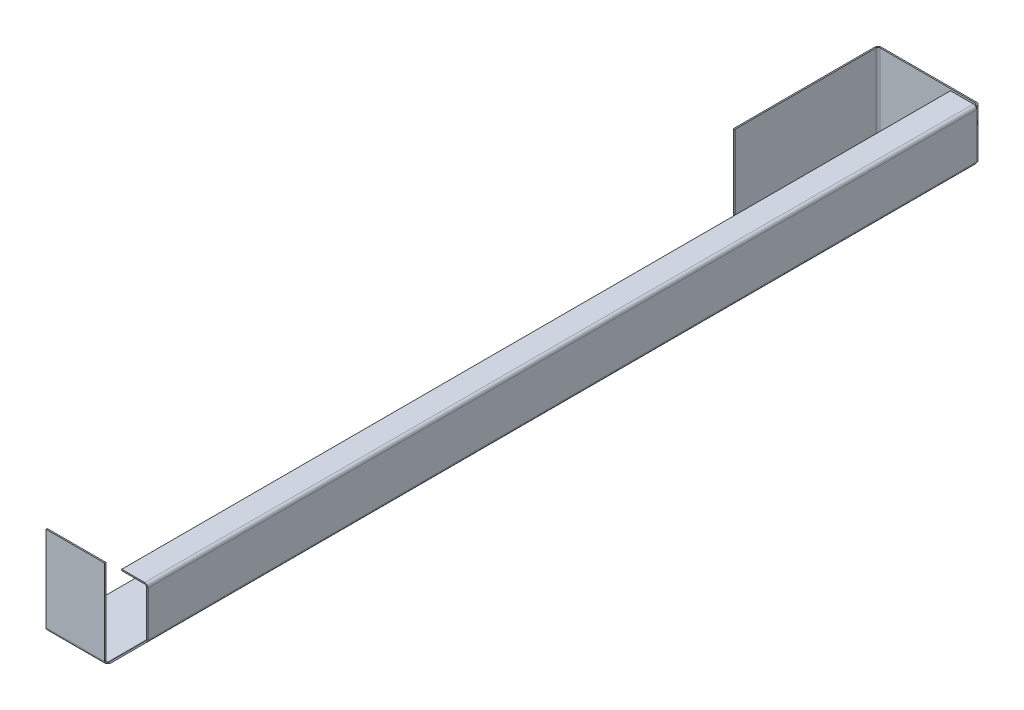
ISO-10303-21;
HEADER;
FILE_DESCRIPTION(('STEP AP214'),'2;1');
FILE_NAME('part.step','',(''),(''),'','','');
FILE_SCHEMA(('AUTOMOTIVE_DESIGN { 1 0 10303 214 1 1 1 1 }'));
ENDSEC;
DATA;
#1=APPLICATION_CONTEXT('core data for automotive mechanical design processes');
#2=APPLICATION_PROTOCOL_DEFINITION('international standard','automotive_design',2000,#1);
#3=PRODUCT_CONTEXT('',#1,'mechanical');
#4=PRODUCT('Part','Part','',(#3));
#5=PRODUCT_RELATED_PRODUCT_CATEGORY('part','',(#4));
#6=PRODUCT_DEFINITION_FORMATION('','',#4);
#7=PRODUCT_DEFINITION_CONTEXT('part definition',#1,'design');
#8=PRODUCT_DEFINITION('design','',#6,#7);
#9=PRODUCT_DEFINITION_SHAPE('','',#8);
#10=(LENGTH_UNIT() NAMED_UNIT(*) SI_UNIT(.MILLI.,.METRE.));
#11=(NAMED_UNIT(*) PLANE_ANGLE_UNIT() SI_UNIT($,.RADIAN.));
#12=(NAMED_UNIT(*) SI_UNIT($,.STERADIAN.) SOLID_ANGLE_UNIT());
#13=UNCERTAINTY_MEASURE_WITH_UNIT(LENGTH_MEASURE(1.E-05),#10,'distance_accuracy_value','');
#14=(GEOMETRIC_REPRESENTATION_CONTEXT(3) GLOBAL_UNCERTAINTY_ASSIGNED_CONTEXT((#13)) GLOBAL_UNIT_ASSIGNED_CONTEXT((#10,
#11,#12)) REPRESENTATION_CONTEXT('',''));
#15=CARTESIAN_POINT('',(0.,0.,0.));
#16=DIRECTION('',(0.,0.,1.));
#17=DIRECTION('',(1.,0.,0.));
#18=AXIS2_PLACEMENT_3D('',#15,#16,#17);
#19=CARTESIAN_POINT('',(867.000002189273,-5.0000000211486,-758.443035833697));
#20=DIRECTION('',(1.04242850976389E-12,-1.51923489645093E-11,-1.));
#21=DIRECTION('',(0.,-1.,1.51923489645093E-11));
#22=AXIS2_PLACEMENT_3D('',#19,#20,#21);
#23=PLANE('',#22);
#24=DIRECTION('',(0.,-1.,-3.86546770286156E-12));
#25=VECTOR('',#24,1.);
#26=CARTESIAN_POINT('',(870.000002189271,-8.78961133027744E-09,-758.443035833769));
#27=LINE('',#26,#25);
#28=CARTESIAN_POINT('',(870.000002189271,-1.00000002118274,-758.443035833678));
#29=VERTEX_POINT('',#28);
#30=CARTESIAN_POINT('',(870.000002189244,-5.00000002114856,-758.443035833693));
#31=VERTEX_POINT('',#30);
#32=EDGE_CURVE('E11',#29,#31,#27,.T.);
#33=ORIENTED_EDGE('',*,*,#32,.T.);
#34=CARTESIAN_POINT('',(867.000002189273,-5.0000000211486,-758.443035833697));
#35=DIRECTION('',(1.04242850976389E-12,-1.51923489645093E-11,-1.));
#36=DIRECTION('',(0.,1.,-1.51923489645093E-11));
#37=AXIS2_PLACEMENT_3D('',#34,#35,#36);
#38=CIRCLE('',#37,2.99999999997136);
#39=CARTESIAN_POINT('',(867.000002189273,-2.00000002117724,-758.443035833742));
#40=VERTEX_POINT('',#39);
#41=EDGE_CURVE('E596',#31,#40,#38,.F.);
#42=ORIENTED_EDGE('',*,*,#41,.T.);
#43=DIRECTION('',(0.,1.,-1.52365122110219E-11));
#44=VECTOR('',#43,1.);
#45=CARTESIAN_POINT('',(867.000002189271,-2.11772417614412E-08,-758.443035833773));
#46=LINE('',#45,#44);
#47=CARTESIAN_POINT('',(867.000002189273,-2.11772409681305E-08,-758.443035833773));
#48=VERTEX_POINT('',#47);
#49=EDGE_CURVE('E321',#40,#48,#46,.T.);
#50=ORIENTED_EDGE('',*,*,#49,.T.);
#51=CARTESIAN_POINT('',(867.000002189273,-5.0000000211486,-758.443035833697));
#52=DIRECTION('',(1.04242850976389E-12,-1.51923489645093E-11,-1.));
#53=DIRECTION('',(0.,1.,-1.51923489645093E-11));
#54=AXIS2_PLACEMENT_3D('',#51,#52,#53);
#55=CIRCLE('',#54,4.99999999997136);
#56=EDGE_CURVE('E607',#29,#48,#55,.F.);
#57=ORIENTED_EDGE('',*,*,#56,.F.);
#58=EDGE_LOOP('',(#33,#42,#50,#57));
#59=FACE_BOUND('',#58,.T.);
#60=ADVANCED_FACE('F28',(#59),#23,.T.);
#61=CARTESIAN_POINT('',(867.000002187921,-5.00000000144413,538.556964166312));
#62=DIRECTION('',(1.04242850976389E-12,-1.51923489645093E-11,-1.));
#63=DIRECTION('',(0.,-1.,1.51923489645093E-11));
#64=AXIS2_PLACEMENT_3D('',#61,#62,#63);
#65=PLANE('',#64);
#66=CARTESIAN_POINT('',(867.000002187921,-5.00000000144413,538.556964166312));
#67=DIRECTION('',(1.04242850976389E-12,-1.51923489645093E-11,-1.));
#68=DIRECTION('',(0.,1.,-1.51923489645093E-11));
#69=AXIS2_PLACEMENT_3D('',#66,#67,#68);
#70=CIRCLE('',#69,2.99999999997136);
#71=CARTESIAN_POINT('',(867.000002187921,-2.00000000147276,538.556964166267));
#72=VERTEX_POINT('',#71);
#73=CARTESIAN_POINT('',(870.000002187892,-5.00000000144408,538.556964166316));
#74=VERTEX_POINT('',#73);
#75=EDGE_CURVE('E593',#72,#74,#70,.T.);
#76=ORIENTED_EDGE('',*,*,#75,.T.);
#77=DIRECTION('',(1.,0.,1.04242850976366E-12));
#78=VECTOR('',#77,1.);
#79=CARTESIAN_POINT('',(870.000002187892,-5.00000000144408,538.556964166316));
#80=LINE('',#79,#78);
#81=CARTESIAN_POINT('',(872.000002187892,-5.00000000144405,538.556964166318));
#82=VERTEX_POINT('',#81);
#83=EDGE_CURVE('E32',#74,#82,#80,.T.);
#84=ORIENTED_EDGE('',*,*,#83,.T.);
#85=CARTESIAN_POINT('',(867.000002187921,-5.00000000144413,538.556964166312));
#86=DIRECTION('',(1.04242850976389E-12,-1.51923489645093E-11,-1.));
#87=DIRECTION('',(0.,1.,-1.51923489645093E-11));
#88=AXIS2_PLACEMENT_3D('',#85,#86,#87);
#89=CIRCLE('',#88,4.99999999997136);
#90=CARTESIAN_POINT('',(867.000002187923,-1.41548552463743E-09,538.556964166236));
#91=VERTEX_POINT('',#90);
#92=EDGE_CURVE('E599',#91,#82,#89,.T.);
#93=ORIENTED_EDGE('',*,*,#92,.F.);
#94=DIRECTION('',(0.,1.,-1.52365122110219E-11));
#95=VECTOR('',#94,1.);
#96=CARTESIAN_POINT('',(867.000002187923,-2.00000000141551,538.556964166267));
#97=LINE('',#96,#95);
#98=EDGE_CURVE('E306',#72,#91,#97,.T.);
#99=ORIENTED_EDGE('',*,*,#98,.F.);
#100=EDGE_LOOP('',(#76,#84,#93,#99));
#101=FACE_BOUND('',#100,.T.);
#102=ADVANCED_FACE('F30',(#101),#65,.F.);
#103=CARTESIAN_POINT('',(867.000002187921,-5.00000000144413,538.556964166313));
#104=DIRECTION('',(-1.04242850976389E-12,1.51923489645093E-11,1.));
#105=DIRECTION('',(0.,1.,-1.51923489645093E-11));
#106=AXIS2_PLACEMENT_3D('',#103,#104,#105);
#107=CYLINDRICAL_SURFACE('',#106,4.99999999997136);
#108=DIRECTION('',(-1.04242850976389E-12,1.51923489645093E-11,1.));
#109=VECTOR('',#108,1.);
#110=CARTESIAN_POINT('',(872.000002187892,-5.00000000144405,538.556964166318));
#111=LINE('',#110,#109);
#112=CARTESIAN_POINT('',(872.000002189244,-5.00000002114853,-758.443035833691));
#113=VERTEX_POINT('',#112);
#114=EDGE_CURVE('E604',#82,#113,#111,.F.);
#115=ORIENTED_EDGE('',*,*,#114,.T.);
#116=EDGE_CURVE('E608',#113,#29,#55,.F.);
#117=ORIENTED_EDGE('',*,*,#116,.T.);
#118=ORIENTED_EDGE('',*,*,#56,.T.);
#119=DIRECTION('',(-1.0390045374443E-12,1.52365122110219E-11,1.));
#120=VECTOR('',#119,1.);
#121=CARTESIAN_POINT('',(867.000002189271,-2.11772418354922E-08,-758.443035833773));
#122=LINE('',#121,#120);
#123=EDGE_CURVE('E316',#91,#48,#122,.F.);
#124=ORIENTED_EDGE('',*,*,#123,.F.);
#125=ORIENTED_EDGE('',*,*,#92,.T.);
#126=EDGE_LOOP('',(#115,#117,#118,#124,#125));
#127=FACE_BOUND('',#126,.T.);
#128=ADVANCED_FACE('F612',(#127),#107,.T.);
#129=CARTESIAN_POINT('',(867.000002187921,-5.00000000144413,538.556964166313));
#130=DIRECTION('',(-1.04242850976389E-12,1.51923489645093E-11,1.));
#131=DIRECTION('',(0.,1.,-1.51923489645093E-11));
#132=AXIS2_PLACEMENT_3D('',#129,#130,#131);
#133=CYLINDRICAL_SURFACE('',#132,2.99999999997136);
#134=DIRECTION('',(-1.04242850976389E-12,1.51923489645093E-11,1.));
#135=VECTOR('',#134,1.);
#136=CARTESIAN_POINT('',(870.000002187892,-5.00000000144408,538.556964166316));
#137=LINE('',#136,#135);
#138=EDGE_CURVE('E600',#74,#31,#137,.F.);
#139=ORIENTED_EDGE('',*,*,#138,.F.);
#140=ORIENTED_EDGE('',*,*,#75,.F.);
#141=DIRECTION('',(-1.0390045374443E-12,1.52365122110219E-11,1.));
#142=VECTOR('',#141,1.);
#143=CARTESIAN_POINT('',(867.000002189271,-2.00000002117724,-758.443035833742));
#144=LINE('',#143,#142);
#145=EDGE_CURVE('E319',#40,#72,#144,.T.);
#146=ORIENTED_EDGE('',*,*,#145,.F.);
#147=ORIENTED_EDGE('',*,*,#41,.F.);
#148=EDGE_LOOP('',(#139,#140,#146,#147));
#149=FACE_BOUND('',#148,.T.);
#150=ADVANCED_FACE('F637',(#149),#133,.F.);
#151=CARTESIAN_POINT('',(872.000002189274,-76.8076929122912,-761.443035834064));
#152=DIRECTION('',(1.,0.,1.03892703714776E-12));
#153=DIRECTION('',(-1.03892703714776E-12,-3.86546770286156E-12,1.));
#154=AXIS2_PLACEMENT_3D('',#151,#152,#153);
#155=PLANE('',#154);
#156=DIRECTION('',(0.,-1.,-3.99555893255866E-12));
#157=VECTOR('',#156,1.);
#158=CARTESIAN_POINT('',(872.000002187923,-76.8076929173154,538.556964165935));
#159=LINE('',#158,#157);
#160=CARTESIAN_POINT('',(872.000002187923,-75.5650522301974,538.55696416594));
#161=VERTEX_POINT('',#160);
#162=EDGE_CURVE('E450',#82,#161,#159,.T.);
#163=ORIENTED_EDGE('',*,*,#162,.T.);
#164=DIRECTION('',(1.04242850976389E-12,3.86546770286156E-12,-1.));
#165=VECTOR('',#164,1.);
#166=CARTESIAN_POINT('',(872.000002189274,-75.5650522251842,-758.44303583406));
#167=LINE('',#166,#165);
#168=CARTESIAN_POINT('',(872.000002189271,-75.5650522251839,-758.44303583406));
#169=VERTEX_POINT('',#168);
#170=EDGE_CURVE('E536',#169,#161,#167,.F.);
#171=ORIENTED_EDGE('',*,*,#170,.F.);
#172=DIRECTION('',(0.,-1.,-3.86546770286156E-12));
#173=VECTOR('',#172,1.);
#174=CARTESIAN_POINT('',(872.000002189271,-76.8076929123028,-758.443035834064));
#175=LINE('',#174,#173);
#176=EDGE_CURVE('E445',#113,#169,#175,.T.);
#177=ORIENTED_EDGE('',*,*,#176,.F.);
#178=ORIENTED_EDGE('',*,*,#114,.F.);
#179=EDGE_LOOP('',(#163,#171,#177,#178));
#180=FACE_BOUND('',#179,.T.);
#181=ADVANCED_FACE('F623',(#180),#155,.T.);
#182=CARTESIAN_POINT('',(870.000002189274,-76.8076929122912,-761.443035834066));
#183=DIRECTION('',(1.,0.,1.03892703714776E-12));
#184=DIRECTION('',(-1.03892703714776E-12,-3.86546770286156E-12,1.));
#185=AXIS2_PLACEMENT_3D('',#182,#183,#184);
#186=PLANE('',#185);
#187=ORIENTED_EDGE('',*,*,#138,.T.);
#188=CARTESIAN_POINT('',(870.000002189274,-75.5650522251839,-758.443035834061));
#189=VERTEX_POINT('',#188);
#190=EDGE_CURVE('E38',#31,#189,#27,.T.);
#191=ORIENTED_EDGE('',*,*,#190,.T.);
#192=DIRECTION('',(1.04242850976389E-12,3.86546770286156E-12,-1.));
#193=VECTOR('',#192,1.);
#194=CARTESIAN_POINT('',(870.000002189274,-75.5650522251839,-758.443035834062));
#195=LINE('',#194,#193);
#196=CARTESIAN_POINT('',(870.000002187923,-75.5650522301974,538.556964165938));
#197=VERTEX_POINT('',#196);
#198=EDGE_CURVE('E532',#189,#197,#195,.F.);
#199=ORIENTED_EDGE('',*,*,#198,.T.);
#200=DIRECTION('',(0.,-1.,-3.99555893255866E-12));
#201=VECTOR('',#200,1.);
#202=CARTESIAN_POINT('',(870.000002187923,-76.8076929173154,538.556964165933));
#203=LINE('',#202,#201);
#204=EDGE_CURVE('E76',#74,#197,#203,.T.);
#205=ORIENTED_EDGE('',*,*,#204,.F.);
#206=EDGE_LOOP('',(#187,#191,#199,#205));
#207=FACE_BOUND('',#206,.T.);
#208=ADVANCED_FACE('F635',(#207),#186,.F.);
#209=CARTESIAN_POINT('',(872.000002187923,-76.8076929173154,538.556964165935));
#210=DIRECTION('',(-1.03893702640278E-12,-3.99555893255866E-12,1.));
#211=DIRECTION('',(0.,1.,3.99555893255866E-12));
#212=AXIS2_PLACEMENT_3D('',#209,#210,#211);
#213=PLANE('',#212);
#214=ORIENTED_EDGE('',*,*,#204,.T.);
#215=DIRECTION('',(1.,-1.5728159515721E-13,1.04242850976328E-12));
#216=VECTOR('',#215,1.);
#217=CARTESIAN_POINT('',(870.000002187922,-75.5650522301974,538.556964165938));
#218=LINE('',#217,#216);
#219=EDGE_CURVE('E542',#197,#161,#218,.T.);
#220=ORIENTED_EDGE('',*,*,#219,.T.);
#221=ORIENTED_EDGE('',*,*,#162,.F.);
#222=ORIENTED_EDGE('',*,*,#83,.F.);
#223=EDGE_LOOP('',(#214,#220,#221,#222));
#224=FACE_BOUND('',#223,.T.);
#225=ADVANCED_FACE('F619',(#224),#213,.T.);
#226=CARTESIAN_POINT('',(809.241800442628,-133.32325397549,538.556964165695));
#227=DIRECTION('',(1.,0.,9.68413641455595E-13));
#228=DIRECTION('',(-9.68413641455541E-13,-3.86546770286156E-12,1.));
#229=AXIS2_PLACEMENT_3D('',#226,#227,#228);
#230=PLANE('',#229);
#231=DIRECTION('',(-1.04242850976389E-12,-3.85848473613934E-12,1.));
#232=VECTOR('',#231,1.);
#233=CARTESIAN_POINT('',(809.241800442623,-133.323253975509,543.556964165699));
#234=LINE('',#233,#232);
#235=CARTESIAN_POINT('',(809.241800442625,-133.323253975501,541.556964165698));
#236=VERTEX_POINT('',#235);
#237=CARTESIAN_POINT('',(809.241800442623,-133.323253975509,543.556964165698));
#238=VERTEX_POINT('',#237);
#239=EDGE_CURVE('E300',#236,#238,#234,.T.);
#240=ORIENTED_EDGE('',*,*,#239,.T.);
#241=CARTESIAN_POINT('',(809.241800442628,-133.32325397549,538.556964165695));
#242=DIRECTION('',(1.,0.,9.68413641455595E-13));
#243=DIRECTION('',(9.68413641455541E-13,3.86546770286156E-12,-1.));
#244=AXIS2_PLACEMENT_3D('',#241,#242,#243);
#245=CIRCLE('',#244,5.00000000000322);
#246=CARTESIAN_POINT('',(809.241800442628,-138.32325397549,538.556964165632));
#247=VERTEX_POINT('',#246);
#248=EDGE_CURVE('E590',#247,#238,#245,.F.);
#249=ORIENTED_EDGE('',*,*,#248,.F.);
#250=DIRECTION('',(0.,-1.,-3.86508484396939E-12));
#251=VECTOR('',#250,1.);
#252=CARTESIAN_POINT('',(809.24180044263,-136.32325397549,538.556964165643));
#253=LINE('',#252,#251);
#254=CARTESIAN_POINT('',(809.241800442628,-136.323253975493,538.556964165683));
#255=VERTEX_POINT('',#254);
#256=EDGE_CURVE('E357',#255,#247,#253,.T.);
#257=ORIENTED_EDGE('',*,*,#256,.F.);
#258=CARTESIAN_POINT('',(809.241800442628,-133.32325397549,538.556964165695));
#259=DIRECTION('',(1.,0.,9.68413641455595E-13));
#260=DIRECTION('',(9.68413641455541E-13,3.86546770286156E-12,-1.));
#261=AXIS2_PLACEMENT_3D('',#258,#259,#260);
#262=CIRCLE('',#261,3.00000000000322);
#263=EDGE_CURVE('E584',#255,#236,#262,.F.);
#264=ORIENTED_EDGE('',*,*,#263,.T.);
#265=EDGE_LOOP('',(#240,#249,#257,#264));
#266=FACE_BOUND('',#265,.T.);
#267=ADVANCED_FACE('F663',(#266),#230,.T.);
#268=CARTESIAN_POINT('',(717.495494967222,-133.323253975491,538.556964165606));
#269=DIRECTION('',(1.,0.,9.68413641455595E-13));
#270=DIRECTION('',(-9.68413641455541E-13,-3.86546770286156E-12,1.));
#271=AXIS2_PLACEMENT_3D('',#268,#269,#270);
#272=PLANE('',#271);
#273=CARTESIAN_POINT('',(717.495494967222,-133.323253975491,538.556964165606));
#274=DIRECTION('',(1.,0.,9.68413641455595E-13));
#275=DIRECTION('',(9.68413641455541E-13,3.86546770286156E-12,-1.));
#276=AXIS2_PLACEMENT_3D('',#273,#274,#275);
#277=CIRCLE('',#276,3.00000000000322);
#278=CARTESIAN_POINT('',(717.495494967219,-133.323253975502,541.55696416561));
#279=VERTEX_POINT('',#278);
#280=CARTESIAN_POINT('',(717.495494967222,-136.323253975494,538.556964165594));
#281=VERTEX_POINT('',#280);
#282=EDGE_CURVE('E581',#279,#281,#277,.T.);
#283=ORIENTED_EDGE('',*,*,#282,.T.);
#284=DIRECTION('',(0.,1.,3.86512530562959E-12));
#285=VECTOR('',#284,1.);
#286=CARTESIAN_POINT('',(717.495494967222,-138.323253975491,538.556964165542));
#287=LINE('',#286,#285);
#288=CARTESIAN_POINT('',(717.495494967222,-138.323253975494,538.556964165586));
#289=VERTEX_POINT('',#288);
#290=EDGE_CURVE('E409',#289,#281,#287,.T.);
#291=ORIENTED_EDGE('',*,*,#290,.F.);
#292=CARTESIAN_POINT('',(717.495494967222,-133.323253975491,538.556964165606));
#293=DIRECTION('',(1.,0.,9.68413641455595E-13));
#294=DIRECTION('',(9.68413641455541E-13,3.86546770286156E-12,-1.));
#295=AXIS2_PLACEMENT_3D('',#292,#293,#294);
#296=CIRCLE('',#295,5.00000000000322);
#297=CARTESIAN_POINT('',(717.495494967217,-133.32325397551,543.556964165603));
#298=VERTEX_POINT('',#297);
#299=EDGE_CURVE('E587',#298,#289,#296,.T.);
#300=ORIENTED_EDGE('',*,*,#299,.F.);
#301=DIRECTION('',(-1.04242850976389E-12,-3.85848473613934E-12,1.));
#302=VECTOR('',#301,1.);
#303=CARTESIAN_POINT('',(717.495494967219,-133.323253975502,541.556964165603));
#304=LINE('',#303,#302);
#305=EDGE_CURVE('E346',#279,#298,#304,.T.);
#306=ORIENTED_EDGE('',*,*,#305,.F.);
#307=EDGE_LOOP('',(#283,#291,#300,#306));
#308=FACE_BOUND('',#307,.T.);
#309=ADVANCED_FACE('F659',(#308),#272,.F.);
#310=CARTESIAN_POINT('',(717.495494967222,-133.323253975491,538.556964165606));
#311=DIRECTION('',(-1.,0.,-9.68413641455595E-13));
#312=DIRECTION('',(-9.68413641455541E-13,-3.86546770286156E-12,1.));
#313=AXIS2_PLACEMENT_3D('',#310,#311,#312);
#314=CYLINDRICAL_SURFACE('',#313,5.00000000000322);
#315=DIRECTION('',(-1.,0.,-9.85119864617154E-13));
#316=VECTOR('',#315,1.);
#317=CARTESIAN_POINT('',(717.495494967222,-138.323253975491,538.556964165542));
#318=LINE('',#317,#316);
#319=EDGE_CURVE('E404',#247,#289,#318,.T.);
#320=ORIENTED_EDGE('',*,*,#319,.F.);
#321=ORIENTED_EDGE('',*,*,#248,.T.);
#322=DIRECTION('',(-1.,0.,-1.04242850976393E-12));
#323=VECTOR('',#322,1.);
#324=CARTESIAN_POINT('',(717.495494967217,-133.32325397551,543.556964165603));
#325=LINE('',#324,#323);
#326=EDGE_CURVE('E343',#238,#298,#325,.T.);
#327=ORIENTED_EDGE('',*,*,#326,.T.);
#328=ORIENTED_EDGE('',*,*,#299,.T.);
#329=EDGE_LOOP('',(#320,#321,#327,#328));
#330=FACE_BOUND('',#329,.T.);
#331=ADVANCED_FACE('F662',(#330),#314,.T.);
#332=CARTESIAN_POINT('',(717.495494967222,-133.323253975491,538.556964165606));
#333=DIRECTION('',(-1.,0.,-9.68413641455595E-13));
#334=DIRECTION('',(-9.68413641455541E-13,-3.86546770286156E-12,1.));
#335=AXIS2_PLACEMENT_3D('',#332,#333,#334);
#336=CYLINDRICAL_SURFACE('',#335,3.00000000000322);
#337=DIRECTION('',(-1.,0.,-9.85119864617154E-13));
#338=VECTOR('',#337,1.);
#339=CARTESIAN_POINT('',(717.495494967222,-136.323253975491,538.55696416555));
#340=LINE('',#339,#338);
#341=EDGE_CURVE('E397',#255,#281,#340,.T.);
#342=ORIENTED_EDGE('',*,*,#341,.T.);
#343=ORIENTED_EDGE('',*,*,#282,.F.);
#344=DIRECTION('',(1.,0.,1.04242850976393E-12));
#345=VECTOR('',#344,1.);
#346=CARTESIAN_POINT('',(809.241800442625,-133.323253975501,541.556964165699));
#347=LINE('',#346,#345);
#348=EDGE_CURVE('E349',#236,#279,#347,.F.);
#349=ORIENTED_EDGE('',*,*,#348,.F.);
#350=ORIENTED_EDGE('',*,*,#263,.F.);
#351=EDGE_LOOP('',(#342,#343,#349,#350));
#352=FACE_BOUND('',#351,.T.);
#353=ADVANCED_FACE('F670',(#352),#336,.F.);
#354=CARTESIAN_POINT('',(717.49549496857,-136.323253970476,-758.443035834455));
#355=DIRECTION('',(0.,-1.,-3.86546770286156E-12));
#356=DIRECTION('',(-1.04242850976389E-12,-3.86546770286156E-12,1.));
#357=AXIS2_PLACEMENT_3D('',#354,#355,#356);
#358=PLANE('',#357);
#359=DIRECTION('',(1.,0.,1.04582040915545E-12));
#360=VECTOR('',#359,1.);
#361=CARTESIAN_POINT('',(712.49549496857,-136.323253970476,-758.443035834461));
#362=LINE('',#361,#360);
#363=CARTESIAN_POINT('',(714.49549496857,-136.323253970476,-758.443035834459));
#364=VERTEX_POINT('',#363);
#365=CARTESIAN_POINT('',(712.49549496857,-136.323253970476,-758.443035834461));
#366=VERTEX_POINT('',#365);
#367=EDGE_CURVE('E327',#364,#366,#362,.F.);
#368=ORIENTED_EDGE('',*,*,#367,.T.);
#369=CARTESIAN_POINT('',(717.49549496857,-136.323253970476,-758.443035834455));
#370=DIRECTION('',(0.,-1.,-3.86546770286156E-12));
#371=DIRECTION('',(1.04242850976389E-12,3.86546770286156E-12,-1.));
#372=AXIS2_PLACEMENT_3D('',#369,#370,#371);
#373=CIRCLE('',#372,5.);
#374=CARTESIAN_POINT('',(717.495494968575,-136.323253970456,-763.443035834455));
#375=VERTEX_POINT('',#374);
#376=EDGE_CURVE('E578',#375,#366,#373,.F.);
#377=ORIENTED_EDGE('',*,*,#376,.F.);
#378=DIRECTION('',(-1.04242850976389E-12,-3.86546770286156E-12,1.));
#379=VECTOR('',#378,1.);
#380=CARTESIAN_POINT('',(717.495494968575,-136.323253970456,-763.443035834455));
#381=LINE('',#380,#379);
#382=CARTESIAN_POINT('',(717.495494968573,-136.323253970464,-761.443035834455));
#383=VERTEX_POINT('',#382);
#384=EDGE_CURVE('E499',#375,#383,#381,.T.);
#385=ORIENTED_EDGE('',*,*,#384,.T.);
#386=CARTESIAN_POINT('',(717.49549496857,-136.323253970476,-758.443035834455));
#387=DIRECTION('',(0.,-1.,-3.86546770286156E-12));
#388=DIRECTION('',(1.04242850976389E-12,3.86546770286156E-12,-1.));
#389=AXIS2_PLACEMENT_3D('',#386,#387,#388);
#390=CIRCLE('',#389,3.);
#391=EDGE_CURVE('E572',#383,#364,#390,.F.);
#392=ORIENTED_EDGE('',*,*,#391,.T.);
#393=EDGE_LOOP('',(#368,#377,#385,#392));
#394=FACE_BOUND('',#393,.T.);
#395=ADVANCED_FACE('F674',(#394),#358,.T.);
#396=CARTESIAN_POINT('',(717.49549496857,-2.08740631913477E-08,-758.443035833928));
#397=DIRECTION('',(0.,-1.,-3.86546770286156E-12));
#398=DIRECTION('',(-1.04242850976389E-12,-3.86546770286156E-12,1.));
#399=AXIS2_PLACEMENT_3D('',#396,#397,#398);
#400=PLANE('',#399);
#401=CARTESIAN_POINT('',(717.49549496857,-2.08740631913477E-08,-758.443035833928));
#402=DIRECTION('',(0.,-1.,-3.86546770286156E-12));
#403=DIRECTION('',(1.04242850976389E-12,3.86546770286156E-12,-1.));
#404=AXIS2_PLACEMENT_3D('',#401,#402,#403);
#405=CIRCLE('',#404,3.);
#406=CARTESIAN_POINT('',(714.49549496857,-2.08740631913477E-08,-758.443035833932));
#407=VERTEX_POINT('',#406);
#408=CARTESIAN_POINT('',(717.495494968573,-2.08624667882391E-08,-761.443035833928));
#409=VERTEX_POINT('',#408);
#410=EDGE_CURVE('E569',#407,#409,#405,.T.);
#411=ORIENTED_EDGE('',*,*,#410,.T.);
#412=DIRECTION('',(-1.04242850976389E-12,-3.86546770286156E-12,1.));
#413=VECTOR('',#412,1.);
#414=CARTESIAN_POINT('',(717.495494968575,-2.11579110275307E-08,-763.443035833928));
#415=LINE('',#414,#413);
#416=CARTESIAN_POINT('',(717.495494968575,-2.08547358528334E-08,-763.443035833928));
#417=VERTEX_POINT('',#416);
#418=EDGE_CURVE('E502',#417,#409,#415,.T.);
#419=ORIENTED_EDGE('',*,*,#418,.F.);
#420=CARTESIAN_POINT('',(717.49549496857,-2.08740631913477E-08,-758.443035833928));
#421=DIRECTION('',(0.,-1.,-3.86546770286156E-12));
#422=DIRECTION('',(1.04242850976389E-12,3.86546770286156E-12,-1.));
#423=AXIS2_PLACEMENT_3D('',#420,#421,#422);
#424=CIRCLE('',#423,5.);
#425=CARTESIAN_POINT('',(712.49549496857,-2.08740631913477E-08,-758.443035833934));
#426=VERTEX_POINT('',#425);
#427=EDGE_CURVE('E575',#426,#417,#424,.T.);
#428=ORIENTED_EDGE('',*,*,#427,.F.);
#429=DIRECTION('',(1.,0.,1.04582040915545E-12));
#430=VECTOR('',#429,1.);
#431=CARTESIAN_POINT('',(714.49549496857,-2.08740642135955E-08,-758.443035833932));
#432=LINE('',#431,#430);
#433=EDGE_CURVE('E378',#407,#426,#432,.F.);
#434=ORIENTED_EDGE('',*,*,#433,.F.);
#435=EDGE_LOOP('',(#411,#419,#428,#434));
#436=FACE_BOUND('',#435,.T.);
#437=ADVANCED_FACE('F676',(#436),#400,.F.);
#438=CARTESIAN_POINT('',(717.49549496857,-2.08740642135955E-08,-758.443035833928));
#439=DIRECTION('',(0.,1.,3.86546770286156E-12));
#440=DIRECTION('',(-1.,0.,-1.04589795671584E-12));
#441=AXIS2_PLACEMENT_3D('',#438,#439,#440);
#442=CYLINDRICAL_SURFACE('',#441,5.);
#443=DIRECTION('',(0.,-1.,-3.86546770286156E-12));
#444=VECTOR('',#443,1.);
#445=CARTESIAN_POINT('',(717.495494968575,-136.323253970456,-763.443035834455));
#446=LINE('',#445,#444);
#447=EDGE_CURVE('E488',#417,#375,#446,.T.);
#448=ORIENTED_EDGE('',*,*,#447,.T.);
#449=ORIENTED_EDGE('',*,*,#376,.T.);
#450=DIRECTION('',(0.,1.,3.86546770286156E-12));
#451=VECTOR('',#450,1.);
#452=CARTESIAN_POINT('',(712.49549496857,-136.323253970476,-758.443035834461));
#453=LINE('',#452,#451);
#454=EDGE_CURVE('E375',#426,#366,#453,.F.);
#455=ORIENTED_EDGE('',*,*,#454,.F.);
#456=ORIENTED_EDGE('',*,*,#427,.T.);
#457=EDGE_LOOP('',(#448,#449,#455,#456));
#458=FACE_BOUND('',#457,.T.);
#459=ADVANCED_FACE('F679',(#458),#442,.T.);
#460=CARTESIAN_POINT('',(717.49549496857,-2.08740642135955E-08,-758.443035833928));
#461=DIRECTION('',(0.,1.,3.86546770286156E-12));
#462=DIRECTION('',(-1.,0.,-1.04589795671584E-12));
#463=AXIS2_PLACEMENT_3D('',#460,#461,#462);
#464=CYLINDRICAL_SURFACE('',#463,3.);
#465=DIRECTION('',(0.,-1.,-3.86546770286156E-12));
#466=VECTOR('',#465,1.);
#467=CARTESIAN_POINT('',(717.495494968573,-136.323253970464,-761.443035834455));
#468=LINE('',#467,#466);
#469=EDGE_CURVE('E478',#409,#383,#468,.T.);
#470=ORIENTED_EDGE('',*,*,#469,.F.);
#471=ORIENTED_EDGE('',*,*,#410,.F.);
#472=DIRECTION('',(0.,1.,3.86546770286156E-12));
#473=VECTOR('',#472,1.);
#474=CARTESIAN_POINT('',(714.49549496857,-136.323253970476,-758.443035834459));
#475=LINE('',#474,#473);
#476=EDGE_CURVE('E381',#364,#407,#475,.T.);
#477=ORIENTED_EDGE('',*,*,#476,.F.);
#478=ORIENTED_EDGE('',*,*,#391,.F.);
#479=EDGE_LOOP('',(#470,#471,#477,#478));
#480=FACE_BOUND('',#479,.T.);
#481=ADVANCED_FACE('F686',(#480),#464,.F.);
#482=CARTESIAN_POINT('',(809.241800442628,-133.323253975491,538.556964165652));
#483=DIRECTION('',(-1.04242850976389E-12,-3.86546770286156E-12,1.));
#484=DIRECTION('',(-1.,0.,-1.04242850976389E-12));
#485=AXIS2_PLACEMENT_3D('',#482,#483,#484);
#486=PLANE('',#485);
#487=ORIENTED_EDGE('',*,*,#256,.T.);
#488=CARTESIAN_POINT('',(809.241800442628,-133.323253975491,538.556964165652));
#489=DIRECTION('',(-1.04242850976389E-12,-3.86546770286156E-12,1.));
#490=DIRECTION('',(1.,0.,1.04242850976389E-12));
#491=AXIS2_PLACEMENT_3D('',#488,#489,#490);
#492=CIRCLE('',#491,4.99999999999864);
#493=CARTESIAN_POINT('',(812.77733434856,-136.858787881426,538.556964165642));
#494=VERTEX_POINT('',#493);
#495=EDGE_CURVE('E560',#494,#247,#492,.F.);
#496=ORIENTED_EDGE('',*,*,#495,.F.);
#497=DIRECTION('',(0.707106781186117,-0.707106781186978,-1.99619015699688E-12));
#498=VECTOR('',#497,1.);
#499=CARTESIAN_POINT('',(811.363120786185,-135.444574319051,538.556964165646));
#500=LINE('',#499,#498);
#501=CARTESIAN_POINT('',(811.363120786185,-135.444574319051,538.556964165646));
#502=VERTEX_POINT('',#501);
#503=EDGE_CURVE('E566',#502,#494,#500,.T.);
#504=ORIENTED_EDGE('',*,*,#503,.F.);
#505=CARTESIAN_POINT('',(809.241800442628,-133.323253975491,538.556964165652));
#506=DIRECTION('',(-1.04242850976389E-12,-3.86546770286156E-12,1.));
#507=DIRECTION('',(1.,0.,1.04242850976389E-12));
#508=AXIS2_PLACEMENT_3D('',#505,#506,#507);
#509=CIRCLE('',#508,2.99999999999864);
#510=EDGE_CURVE('E548',#502,#255,#509,.F.);
#511=ORIENTED_EDGE('',*,*,#510,.T.);
#512=EDGE_LOOP('',(#487,#496,#504,#511));
#513=FACE_BOUND('',#512,.T.);
#514=ADVANCED_FACE('F690',(#513),#486,.T.);
#515=CARTESIAN_POINT('',(809.24180044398,-133.323253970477,-758.443035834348));
#516=DIRECTION('',(-1.04242850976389E-12,-3.86546770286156E-12,1.));
#517=DIRECTION('',(-1.,0.,-1.04242850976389E-12));
#518=AXIS2_PLACEMENT_3D('',#515,#516,#517);
#519=PLANE('',#518);
#520=CARTESIAN_POINT('',(809.24180044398,-133.323253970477,-758.443035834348));
#521=DIRECTION('',(-1.04242850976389E-12,-3.86546770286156E-12,1.));
#522=DIRECTION('',(1.,0.,1.04242850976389E-12));
#523=AXIS2_PLACEMENT_3D('',#520,#521,#522);
#524=CIRCLE('',#523,2.99999999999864);
#525=CARTESIAN_POINT('',(809.24180044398,-136.323253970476,-758.443035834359));
#526=VERTEX_POINT('',#525);
#527=CARTESIAN_POINT('',(811.363120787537,-135.444574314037,-758.443035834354));
#528=VERTEX_POINT('',#527);
#529=EDGE_CURVE('E547',#526,#528,#524,.T.);
#530=ORIENTED_EDGE('',*,*,#529,.T.);
#531=DIRECTION('',(0.707106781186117,-0.707106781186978,-1.99619015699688E-12));
#532=VECTOR('',#531,1.);
#533=CARTESIAN_POINT('',(811.363120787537,-135.444574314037,-758.443035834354));
#534=LINE('',#533,#532);
#535=CARTESIAN_POINT('',(812.777334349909,-136.858787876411,-758.443035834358));
#536=VERTEX_POINT('',#535);
#537=EDGE_CURVE('E563',#528,#536,#534,.T.);
#538=ORIENTED_EDGE('',*,*,#537,.T.);
#539=CARTESIAN_POINT('',(809.24180044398,-133.323253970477,-758.443035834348));
#540=DIRECTION('',(-1.04242850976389E-12,-3.86546770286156E-12,1.));
#541=DIRECTION('',(1.,0.,1.04242850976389E-12));
#542=AXIS2_PLACEMENT_3D('',#539,#540,#541);
#543=CIRCLE('',#542,4.99999999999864);
#544=CARTESIAN_POINT('',(809.24180044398,-138.323253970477,-758.443035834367));
#545=VERTEX_POINT('',#544);
#546=EDGE_CURVE('E551',#545,#536,#543,.T.);
#547=ORIENTED_EDGE('',*,*,#546,.F.);
#548=DIRECTION('',(0.,-1.,-3.86508484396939E-12));
#549=VECTOR('',#548,1.);
#550=CARTESIAN_POINT('',(809.241800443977,-136.323253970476,-758.443035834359));
#551=LINE('',#550,#549);
#552=EDGE_CURVE('E389',#526,#545,#551,.T.);
#553=ORIENTED_EDGE('',*,*,#552,.F.);
#554=EDGE_LOOP('',(#530,#538,#547,#553));
#555=FACE_BOUND('',#554,.T.);
#556=ADVANCED_FACE('F692',(#555),#519,.F.);
#557=CARTESIAN_POINT('',(809.24180044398,-133.323253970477,-758.443035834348));
#558=DIRECTION('',(1.04242850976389E-12,3.86546770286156E-12,-1.));
#559=DIRECTION('',(0.,-1.,-3.86546770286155E-12));
#560=AXIS2_PLACEMENT_3D('',#557,#558,#559);
#561=CYLINDRICAL_SURFACE('',#560,4.99999999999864);
#562=DIRECTION('',(1.04242850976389E-12,3.86546770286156E-12,-1.));
#563=VECTOR('',#562,1.);
#564=CARTESIAN_POINT('',(812.777334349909,-136.858787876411,-758.443035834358));
#565=LINE('',#564,#563);
#566=EDGE_CURVE('E557',#536,#494,#565,.F.);
#567=ORIENTED_EDGE('',*,*,#566,.T.);
#568=ORIENTED_EDGE('',*,*,#495,.T.);
#569=DIRECTION('',(1.03883333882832E-12,3.8651253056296E-12,-1.));
#570=VECTOR('',#569,1.);
#571=CARTESIAN_POINT('',(809.241800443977,-138.323253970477,-758.443035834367));
#572=LINE('',#571,#570);
#573=EDGE_CURVE('E392',#247,#545,#572,.T.);
#574=ORIENTED_EDGE('',*,*,#573,.T.);
#575=ORIENTED_EDGE('',*,*,#546,.T.);
#576=EDGE_LOOP('',(#567,#568,#574,#575));
#577=FACE_BOUND('',#576,.T.);
#578=ADVANCED_FACE('F695',(#577),#561,.T.);
#579=CARTESIAN_POINT('',(809.24180044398,-133.323253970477,-758.443035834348));
#580=DIRECTION('',(1.04242850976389E-12,3.86546770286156E-12,-1.));
#581=DIRECTION('',(0.,-1.,-3.86546770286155E-12));
#582=AXIS2_PLACEMENT_3D('',#579,#580,#581);
#583=CYLINDRICAL_SURFACE('',#582,2.99999999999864);
#584=DIRECTION('',(1.04242850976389E-12,3.86546770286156E-12,-1.));
#585=VECTOR('',#584,1.);
#586=CARTESIAN_POINT('',(811.363120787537,-135.444574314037,-758.443035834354));
#587=LINE('',#586,#585);
#588=EDGE_CURVE('E552',#528,#502,#587,.F.);
#589=ORIENTED_EDGE('',*,*,#588,.F.);
#590=ORIENTED_EDGE('',*,*,#529,.F.);
#591=DIRECTION('',(1.03883333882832E-12,3.86521090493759E-12,-1.));
#592=VECTOR('',#591,1.);
#593=CARTESIAN_POINT('',(809.24180044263,-136.32325397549,538.556964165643));
#594=LINE('',#593,#592);
#595=EDGE_CURVE('E386',#255,#526,#594,.T.);
#596=ORIENTED_EDGE('',*,*,#595,.F.);
#597=ORIENTED_EDGE('',*,*,#510,.F.);
#598=EDGE_LOOP('',(#589,#590,#596,#597));
#599=FACE_BOUND('',#598,.T.);
#600=ADVANCED_FACE('F702',(#599),#583,.F.);
#601=CARTESIAN_POINT('',(871.414215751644,-78.2219064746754,-758.44303583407));
#602=DIRECTION('',(1.03891755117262E-12,3.86512391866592E-12,-1.));
#603=DIRECTION('',(1.,0.,1.03891755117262E-12));
#604=AXIS2_PLACEMENT_3D('',#601,#602,#603);
#605=PLANE('',#604);
#606=DIRECTION('',(0.707106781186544,0.707106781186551,3.46768097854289E-12));
#607=VECTOR('',#606,1.);
#608=CARTESIAN_POINT('',(870.000002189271,-76.8076929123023,-758.443035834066));
#609=LINE('',#608,#607);
#610=CARTESIAN_POINT('',(869.121322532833,-77.6863725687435,-758.443035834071));
#611=VERTEX_POINT('',#610);
#612=EDGE_CURVE('E428',#528,#611,#609,.T.);
#613=ORIENTED_EDGE('',*,*,#612,.T.);
#614=DIRECTION('',(0.707106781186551,-0.707106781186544,-1.99847183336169E-12));
#615=VECTOR('',#614,1.);
#616=CARTESIAN_POINT('',(869.12132253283,-77.6863725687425,-758.443035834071));
#617=LINE('',#616,#615);
#618=CARTESIAN_POINT('',(870.535536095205,-79.1005861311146,-758.443035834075));
#619=VERTEX_POINT('',#618);
#620=EDGE_CURVE('E418',#611,#619,#617,.T.);
#621=ORIENTED_EDGE('',*,*,#620,.T.);
#622=DIRECTION('',(0.707106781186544,0.707106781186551,3.46768097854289E-12));
#623=VECTOR('',#622,1.);
#624=CARTESIAN_POINT('',(871.414215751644,-78.2219064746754,-758.44303583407));
#625=LINE('',#624,#623);
#626=EDGE_CURVE('E433',#536,#619,#625,.T.);
#627=ORIENTED_EDGE('',*,*,#626,.F.);
#628=ORIENTED_EDGE('',*,*,#537,.F.);
#629=EDGE_LOOP('',(#613,#621,#627,#628));
#630=FACE_BOUND('',#629,.T.);
#631=ADVANCED_FACE('F706',(#630),#605,.T.);
#632=CARTESIAN_POINT('',(871.414215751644,-78.2219064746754,-758.44303583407));
#633=DIRECTION('',(0.707106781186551,-0.707106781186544,-1.99842968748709E-12));
#634=DIRECTION('',(0.707106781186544,0.707106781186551,3.47040669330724E-12));
#635=AXIS2_PLACEMENT_3D('',#632,#633,#634);
#636=PLANE('',#635);
#637=ORIENTED_EDGE('',*,*,#626,.T.);
#638=DIRECTION('',(1.03891893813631E-12,3.8651253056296E-12,-1.));
#639=VECTOR('',#638,1.);
#640=CARTESIAN_POINT('',(870.535536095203,-79.1005861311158,-758.443035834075));
#641=LINE('',#640,#639);
#642=CARTESIAN_POINT('',(870.535536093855,-79.1005861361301,538.556964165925));
#643=VERTEX_POINT('',#642);
#644=EDGE_CURVE('E421',#643,#619,#641,.T.);
#645=ORIENTED_EDGE('',*,*,#644,.F.);
#646=DIRECTION('',(-0.707106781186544,-0.707106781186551,-3.4677685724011E-12));
#647=VECTOR('',#646,1.);
#648=CARTESIAN_POINT('',(811.898654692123,-137.737467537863,538.556964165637));
#649=LINE('',#648,#647);
#650=EDGE_CURVE('E431',#643,#494,#649,.T.);
#651=ORIENTED_EDGE('',*,*,#650,.T.);
#652=ORIENTED_EDGE('',*,*,#566,.F.);
#653=EDGE_LOOP('',(#637,#645,#651,#652));
#654=FACE_BOUND('',#653,.T.);
#655=ADVANCED_FACE('F787',(#654),#636,.T.);
#656=CARTESIAN_POINT('',(870.000002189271,-76.8076929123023,-758.443035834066));
#657=DIRECTION('',(0.707106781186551,-0.707106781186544,-1.99842968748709E-12));
#658=DIRECTION('',(0.707106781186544,0.707106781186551,3.47040669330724E-12));
#659=AXIS2_PLACEMENT_3D('',#656,#657,#658);
#660=PLANE('',#659);
#661=ORIENTED_EDGE('',*,*,#588,.T.);
#662=DIRECTION('',(-0.707106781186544,-0.707106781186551,-3.4677685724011E-12));
#663=VECTOR('',#662,1.);
#664=CARTESIAN_POINT('',(810.484441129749,-136.32325397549,538.556964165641));
#665=LINE('',#664,#663);
#666=CARTESIAN_POINT('',(869.121322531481,-77.686372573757,538.556964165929));
#667=VERTEX_POINT('',#666);
#668=EDGE_CURVE('E426',#667,#502,#665,.T.);
#669=ORIENTED_EDGE('',*,*,#668,.F.);
#670=DIRECTION('',(1.03883333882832E-12,3.86521090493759E-12,-1.));
#671=VECTOR('',#670,1.);
#672=CARTESIAN_POINT('',(869.121322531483,-77.6863725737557,538.556964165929));
#673=LINE('',#672,#671);
#674=EDGE_CURVE('E415',#667,#611,#673,.T.);
#675=ORIENTED_EDGE('',*,*,#674,.T.);
#676=ORIENTED_EDGE('',*,*,#612,.F.);
#677=EDGE_LOOP('',(#661,#669,#675,#676));
#678=FACE_BOUND('',#677,.T.);
#679=ADVANCED_FACE('F716',(#678),#660,.F.);
#680=CARTESIAN_POINT('',(867.000002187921,-75.5650522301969,538.556964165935));
#681=DIRECTION('',(-1.04242850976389E-12,-3.86546770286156E-12,1.));
#682=DIRECTION('',(-1.,0.,-1.04242850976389E-12));
#683=AXIS2_PLACEMENT_3D('',#680,#681,#682);
#684=PLANE('',#683);
#685=DIRECTION('',(0.707106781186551,-0.707106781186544,-1.99847183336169E-12));
#686=VECTOR('',#685,1.);
#687=CARTESIAN_POINT('',(869.121322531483,-77.6863725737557,538.556964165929));
#688=LINE('',#687,#686);
#689=EDGE_CURVE('E413',#667,#643,#688,.T.);
#690=ORIENTED_EDGE('',*,*,#689,.T.);
#691=CARTESIAN_POINT('',(867.000002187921,-75.5650522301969,538.556964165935));
#692=DIRECTION('',(-1.04242850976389E-12,-3.86546770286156E-12,1.));
#693=DIRECTION('',(1.,0.,1.04242850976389E-12));
#694=AXIS2_PLACEMENT_3D('',#691,#692,#693);
#695=CIRCLE('',#694,5.00000000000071);
#696=EDGE_CURVE('E539',#161,#643,#695,.F.);
#697=ORIENTED_EDGE('',*,*,#696,.F.);
#698=ORIENTED_EDGE('',*,*,#219,.F.);
#699=CARTESIAN_POINT('',(867.000002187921,-75.5650522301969,538.556964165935));
#700=DIRECTION('',(-1.04242850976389E-12,-3.86546770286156E-12,1.));
#701=DIRECTION('',(1.,0.,1.04242850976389E-12));
#702=AXIS2_PLACEMENT_3D('',#699,#700,#701);
#703=CIRCLE('',#702,3.00000000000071);
#704=EDGE_CURVE('E529',#197,#667,#703,.F.);
#705=ORIENTED_EDGE('',*,*,#704,.T.);
#706=EDGE_LOOP('',(#690,#697,#698,#705));
#707=FACE_BOUND('',#706,.T.);
#708=ADVANCED_FACE('F712',(#707),#684,.T.);
#709=CARTESIAN_POINT('',(867.000002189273,-75.5650522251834,-758.443035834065));
#710=DIRECTION('',(-1.04242850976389E-12,-3.86546770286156E-12,1.));
#711=DIRECTION('',(-1.,0.,-1.04242850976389E-12));
#712=AXIS2_PLACEMENT_3D('',#709,#710,#711);
#713=PLANE('',#712);
#714=DIRECTION('',(1.,0.,1.03903661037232E-12));
#715=VECTOR('',#714,1.);
#716=CARTESIAN_POINT('',(870.000002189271,-76.8076929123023,-758.443035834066));
#717=LINE('',#716,#715);
#718=CARTESIAN_POINT('',(870.000002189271,-76.8076929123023,-758.443035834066));
#719=VERTEX_POINT('',#718);
#720=CARTESIAN_POINT('',(871.843125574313,-76.8076929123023,-758.443035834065));
#721=VERTEX_POINT('',#720);
#722=EDGE_CURVE('E442',#719,#721,#717,.T.);
#723=ORIENTED_EDGE('',*,*,#722,.T.);
#724=CARTESIAN_POINT('',(867.000002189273,-75.5650522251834,-758.443035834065));
#725=DIRECTION('',(-1.04242850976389E-12,-3.86546770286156E-12,1.));
#726=DIRECTION('',(1.,0.,1.04242850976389E-12));
#727=AXIS2_PLACEMENT_3D('',#724,#725,#726);
#728=CIRCLE('',#727,5.00000000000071);
#729=EDGE_CURVE('E540',#619,#721,#728,.T.);
#730=ORIENTED_EDGE('',*,*,#729,.F.);
#731=ORIENTED_EDGE('',*,*,#620,.F.);
#732=CARTESIAN_POINT('',(867.000002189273,-75.5650522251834,-758.443035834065));
#733=DIRECTION('',(-1.04242850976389E-12,-3.86546770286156E-12,1.));
#734=DIRECTION('',(1.,0.,1.04242850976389E-12));
#735=AXIS2_PLACEMENT_3D('',#732,#733,#734);
#736=CIRCLE('',#735,3.00000000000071);
#737=EDGE_CURVE('E526',#611,#189,#736,.T.);
#738=ORIENTED_EDGE('',*,*,#737,.T.);
#739=DIRECTION('',(2.76965933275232E-12,1.,3.95516055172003E-12));
#740=VECTOR('',#739,1.);
#741=CARTESIAN_POINT('',(870.000002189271,-76.8076929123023,-758.443035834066));
#742=LINE('',#741,#740);
#743=EDGE_CURVE('E436',#719,#189,#742,.T.);
#744=ORIENTED_EDGE('',*,*,#743,.F.);
#745=EDGE_LOOP('',(#723,#730,#731,#738,#744));
#746=FACE_BOUND('',#745,.T.);
#747=ADVANCED_FACE('F708',(#746),#713,.F.);
#748=CARTESIAN_POINT('',(867.000002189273,-75.5650522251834,-758.443035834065));
#749=DIRECTION('',(1.04242850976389E-12,3.86546770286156E-12,-1.));
#750=DIRECTION('',(0.707106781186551,-0.707106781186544,-1.99619015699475E-12));
#751=AXIS2_PLACEMENT_3D('',#748,#749,#750);
#752=CYLINDRICAL_SURFACE('',#751,5.00000000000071);
#753=ORIENTED_EDGE('',*,*,#170,.T.);
#754=ORIENTED_EDGE('',*,*,#696,.T.);
#755=ORIENTED_EDGE('',*,*,#644,.T.);
#756=ORIENTED_EDGE('',*,*,#729,.T.);
#757=EDGE_CURVE('E531',#721,#169,#728,.T.);
#758=ORIENTED_EDGE('',*,*,#757,.T.);
#759=EDGE_LOOP('',(#753,#754,#755,#756,#758));
#760=FACE_BOUND('',#759,.T.);
#761=ADVANCED_FACE('F711',(#760),#752,.T.);
#762=CARTESIAN_POINT('',(867.000002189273,-75.5650522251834,-758.443035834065));
#763=DIRECTION('',(1.04242850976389E-12,3.86546770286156E-12,-1.));
#764=DIRECTION('',(0.707106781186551,-0.707106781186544,-1.99619015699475E-12));
#765=AXIS2_PLACEMENT_3D('',#762,#763,#764);
#766=CYLINDRICAL_SURFACE('',#765,3.00000000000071);
#767=ORIENTED_EDGE('',*,*,#198,.F.);
#768=ORIENTED_EDGE('',*,*,#737,.F.);
#769=ORIENTED_EDGE('',*,*,#674,.F.);
#770=ORIENTED_EDGE('',*,*,#704,.F.);
#771=EDGE_LOOP('',(#767,#768,#769,#770));
#772=FACE_BOUND('',#771,.T.);
#773=ADVANCED_FACE('F720',(#772),#766,.F.);
#774=CARTESIAN_POINT('',(867.000002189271,-2.11772522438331E-08,-758.443035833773));
#775=DIRECTION('',(0.,1.,3.86546770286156E-12));
#776=DIRECTION('',(1.04242850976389E-12,3.86546770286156E-12,-1.));
#777=AXIS2_PLACEMENT_3D('',#774,#775,#776);
#778=PLANE('',#777);
#779=DIRECTION('',(1.,0.,1.03903661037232E-12));
#780=VECTOR('',#779,1.);
#781=CARTESIAN_POINT('',(870.000002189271,-8.78961133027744E-09,-758.443035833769));
#782=LINE('',#781,#780);
#783=CARTESIAN_POINT('',(870.000002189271,-2.11772522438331E-08,-758.443035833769));
#784=VERTEX_POINT('',#783);
#785=CARTESIAN_POINT('',(872.000002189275,-2.11772522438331E-08,-758.443035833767));
#786=VERTEX_POINT('',#785);
#787=EDGE_CURVE('E439',#784,#786,#782,.T.);
#788=ORIENTED_EDGE('',*,*,#787,.T.);
#789=CARTESIAN_POINT('',(867.000002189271,-2.11772522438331E-08,-758.443035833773));
#790=DIRECTION('',(0.,1.,3.86546770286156E-12));
#791=DIRECTION('',(-1.04242850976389E-12,-3.86546770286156E-12,1.));
#792=AXIS2_PLACEMENT_3D('',#789,#790,#791);
#793=CIRCLE('',#792,5.);
#794=CARTESIAN_POINT('',(867.000002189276,-2.11579249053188E-08,-763.443035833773));
#795=VERTEX_POINT('',#794);
#796=EDGE_CURVE('E518',#795,#786,#793,.F.);
#797=ORIENTED_EDGE('',*,*,#796,.F.);
#798=DIRECTION('',(1.04242850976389E-12,3.86546770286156E-12,-1.));
#799=VECTOR('',#798,1.);
#800=CARTESIAN_POINT('',(867.000002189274,-2.11656558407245E-08,-761.443035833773));
#801=LINE('',#800,#799);
#802=CARTESIAN_POINT('',(867.000002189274,-2.11656558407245E-08,-761.443035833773));
#803=VERTEX_POINT('',#802);
#804=EDGE_CURVE('E523',#803,#795,#801,.T.);
#805=ORIENTED_EDGE('',*,*,#804,.F.);
#806=CARTESIAN_POINT('',(867.000002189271,-2.11772522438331E-08,-758.443035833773));
#807=DIRECTION('',(0.,1.,3.86546770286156E-12));
#808=DIRECTION('',(-1.04242850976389E-12,-3.86546770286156E-12,1.));
#809=AXIS2_PLACEMENT_3D('',#806,#807,#808);
#810=CIRCLE('',#809,3.);
#811=EDGE_CURVE('E506',#803,#784,#810,.F.);
#812=ORIENTED_EDGE('',*,*,#811,.T.);
#813=EDGE_LOOP('',(#788,#797,#805,#812));
#814=FACE_BOUND('',#813,.T.);
#815=ADVANCED_FACE('F724',(#814),#778,.T.);
#816=CARTESIAN_POINT('',(867.000002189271,-76.8076929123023,-758.44303583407));
#817=DIRECTION('',(0.,1.,3.86546770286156E-12));
#818=DIRECTION('',(1.04242850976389E-12,3.86546770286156E-12,-1.));
#819=AXIS2_PLACEMENT_3D('',#816,#817,#818);
#820=PLANE('',#819);
#821=CARTESIAN_POINT('',(867.000002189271,-76.8076929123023,-758.44303583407));
#822=DIRECTION('',(0.,1.,3.86546770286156E-12));
#823=DIRECTION('',(-1.04242850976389E-12,-3.86546770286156E-12,1.));
#824=AXIS2_PLACEMENT_3D('',#821,#822,#823);
#825=CIRCLE('',#824,3.);
#826=CARTESIAN_POINT('',(867.000002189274,-76.8076929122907,-761.44303583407));
#827=VERTEX_POINT('',#826);
#828=EDGE_CURVE('E505',#719,#827,#825,.T.);
#829=ORIENTED_EDGE('',*,*,#828,.T.);
#830=DIRECTION('',(1.04242850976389E-12,3.86546770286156E-12,-1.));
#831=VECTOR('',#830,1.);
#832=CARTESIAN_POINT('',(867.000002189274,-76.8076929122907,-761.44303583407));
#833=LINE('',#832,#831);
#834=CARTESIAN_POINT('',(867.000002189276,-76.807692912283,-763.44303583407));
#835=VERTEX_POINT('',#834);
#836=EDGE_CURVE('E520',#827,#835,#833,.T.);
#837=ORIENTED_EDGE('',*,*,#836,.T.);
#838=CARTESIAN_POINT('',(867.000002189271,-76.8076929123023,-758.44303583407));
#839=DIRECTION('',(0.,1.,3.86546770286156E-12));
#840=DIRECTION('',(-1.04242850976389E-12,-3.86546770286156E-12,1.));
#841=AXIS2_PLACEMENT_3D('',#838,#839,#840);
#842=CIRCLE('',#841,5.);
#843=CARTESIAN_POINT('',(872.000002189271,-76.8076929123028,-758.443035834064));
#844=VERTEX_POINT('',#843);
#845=EDGE_CURVE('E509',#844,#835,#842,.T.);
#846=ORIENTED_EDGE('',*,*,#845,.F.);
#847=EDGE_CURVE('E441',#721,#844,#717,.T.);
#848=ORIENTED_EDGE('',*,*,#847,.F.);
#849=ORIENTED_EDGE('',*,*,#722,.F.);
#850=EDGE_LOOP('',(#829,#837,#846,#848,#849));
#851=FACE_BOUND('',#850,.T.);
#852=ADVANCED_FACE('F726',(#851),#820,.F.);
#853=CARTESIAN_POINT('',(867.000002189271,-76.8076929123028,-758.44303583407));
#854=DIRECTION('',(0.,-1.,-3.86546770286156E-12));
#855=DIRECTION('',(1.,0.,1.03892703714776E-12));
#856=AXIS2_PLACEMENT_3D('',#853,#854,#855);
#857=CYLINDRICAL_SURFACE('',#856,5.);
#858=DIRECTION('',(0.,-1.,-3.86546770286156E-12));
#859=VECTOR('',#858,1.);
#860=CARTESIAN_POINT('',(867.000002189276,-76.8076929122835,-763.44303583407));
#861=LINE('',#860,#859);
#862=EDGE_CURVE('E515',#835,#795,#861,.F.);
#863=ORIENTED_EDGE('',*,*,#862,.T.);
#864=ORIENTED_EDGE('',*,*,#796,.T.);
#865=EDGE_CURVE('E54',#786,#113,#175,.T.);
#866=ORIENTED_EDGE('',*,*,#865,.T.);
#867=ORIENTED_EDGE('',*,*,#176,.T.);
#868=DIRECTION('',(0.,1.,3.95516055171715E-12));
#869=VECTOR('',#868,1.);
#870=CARTESIAN_POINT('',(872.000002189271,-76.8076929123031,-758.443035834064));
#871=LINE('',#870,#869);
#872=EDGE_CURVE('E438',#844,#169,#871,.T.);
#873=ORIENTED_EDGE('',*,*,#872,.F.);
#874=ORIENTED_EDGE('',*,*,#845,.T.);
#875=EDGE_LOOP('',(#863,#864,#866,#867,#873,#874));
#876=FACE_BOUND('',#875,.T.);
#877=ADVANCED_FACE('F729',(#876),#857,.T.);
#878=CARTESIAN_POINT('',(867.000002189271,-76.8076929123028,-758.44303583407));
#879=DIRECTION('',(0.,-1.,-3.86546770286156E-12));
#880=DIRECTION('',(1.,0.,1.03892703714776E-12));
#881=AXIS2_PLACEMENT_3D('',#878,#879,#880);
#882=CYLINDRICAL_SURFACE('',#881,3.);
#883=DIRECTION('',(0.,-1.,-3.86546770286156E-12));
#884=VECTOR('',#883,1.);
#885=CARTESIAN_POINT('',(867.000002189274,-76.8076929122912,-761.44303583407));
#886=LINE('',#885,#884);
#887=EDGE_CURVE('E510',#827,#803,#886,.F.);
#888=ORIENTED_EDGE('',*,*,#887,.F.);
#889=ORIENTED_EDGE('',*,*,#828,.F.);
#890=ORIENTED_EDGE('',*,*,#743,.T.);
#891=ORIENTED_EDGE('',*,*,#190,.F.);
#892=ORIENTED_EDGE('',*,*,#32,.F.);
#893=EDGE_CURVE('E39',#784,#29,#27,.T.);
#894=ORIENTED_EDGE('',*,*,#893,.F.);
#895=ORIENTED_EDGE('',*,*,#811,.F.);
#896=EDGE_LOOP('',(#888,#889,#890,#891,#892,#894,#895));
#897=FACE_BOUND('',#896,.T.);
#898=ADVANCED_FACE('F630',(#897),#882,.F.);
#899=CARTESIAN_POINT('',(717.495494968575,-2.11579110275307E-08,-763.443035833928));
#900=DIRECTION('',(0.,-1.,-3.86546770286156E-12));
#901=DIRECTION('',(-1.04242850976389E-12,-3.86546770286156E-12,1.));
#902=AXIS2_PLACEMENT_3D('',#899,#900,#901);
#903=PLANE('',#902);
#904=ORIENTED_EDGE('',*,*,#804,.T.);
#905=DIRECTION('',(-1.,0.,-1.04242850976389E-12));
#906=VECTOR('',#905,1.);
#907=CARTESIAN_POINT('',(717.495494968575,-2.11579110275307E-08,-763.443035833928));
#908=LINE('',#907,#906);
#909=EDGE_CURVE('E486',#795,#417,#908,.T.);
#910=ORIENTED_EDGE('',*,*,#909,.T.);
#911=ORIENTED_EDGE('',*,*,#418,.T.);
#912=DIRECTION('',(-1.,0.,-1.04242850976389E-12));
#913=VECTOR('',#912,1.);
#914=CARTESIAN_POINT('',(717.495494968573,-2.11656419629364E-08,-761.443035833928));
#915=LINE('',#914,#913);
#916=EDGE_CURVE('E476',#803,#409,#915,.T.);
#917=ORIENTED_EDGE('',*,*,#916,.F.);
#918=EDGE_LOOP('',(#904,#910,#911,#917));
#919=FACE_BOUND('',#918,.T.);
#920=ADVANCED_FACE('F738',(#919),#903,.F.);
#921=CARTESIAN_POINT('',(870.000002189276,-76.8076929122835,-763.443035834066));
#922=DIRECTION('',(-0.707106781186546,0.707106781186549,1.99619015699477E-12));
#923=DIRECTION('',(-0.707106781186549,-0.707106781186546,-3.47040669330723E-12));
#924=AXIS2_PLACEMENT_3D('',#921,#922,#923);
#925=PLANE('',#924);
#926=DIRECTION('',(1.04242850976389E-12,3.86546770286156E-12,-1.));
#927=VECTOR('',#926,1.);
#928=CARTESIAN_POINT('',(869.000002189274,-77.8076929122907,-761.443035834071));
#929=LINE('',#928,#927);
#930=CARTESIAN_POINT('',(869.000002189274,-77.8076929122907,-761.443035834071));
#931=VERTEX_POINT('',#930);
#932=CARTESIAN_POINT('',(869.000002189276,-77.807692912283,-763.443035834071));
#933=VERTEX_POINT('',#932);
#934=EDGE_CURVE('E458',#931,#933,#929,.T.);
#935=ORIENTED_EDGE('',*,*,#934,.F.);
#936=DIRECTION('',(0.707106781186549,0.707106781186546,3.47040669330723E-12));
#937=VECTOR('',#936,1.);
#938=CARTESIAN_POINT('',(870.000002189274,-76.8076929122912,-761.443035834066));
#939=LINE('',#938,#937);
#940=CARTESIAN_POINT('',(810.484441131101,-136.323253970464,-761.443035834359));
#941=VERTEX_POINT('',#940);
#942=EDGE_CURVE('E483',#941,#931,#939,.T.);
#943=ORIENTED_EDGE('',*,*,#942,.F.);
#944=DIRECTION('',(-1.04242850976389E-12,-3.86546770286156E-12,1.));
#945=VECTOR('',#944,1.);
#946=CARTESIAN_POINT('',(810.484441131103,-136.323253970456,-763.443035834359));
#947=LINE('',#946,#945);
#948=CARTESIAN_POINT('',(810.484441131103,-136.323253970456,-763.443035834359));
#949=VERTEX_POINT('',#948);
#950=EDGE_CURVE('E496',#949,#941,#947,.T.);
#951=ORIENTED_EDGE('',*,*,#950,.F.);
#952=DIRECTION('',(0.707106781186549,0.707106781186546,3.47040669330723E-12));
#953=VECTOR('',#952,1.);
#954=CARTESIAN_POINT('',(870.000002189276,-76.8076929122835,-763.443035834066));
#955=LINE('',#954,#953);
#956=EDGE_CURVE('E493',#949,#933,#955,.T.);
#957=ORIENTED_EDGE('',*,*,#956,.T.);
#958=EDGE_LOOP('',(#935,#943,#951,#957));
#959=FACE_BOUND('',#958,.T.);
#960=ADVANCED_FACE('F741',(#959),#925,.F.);
#961=CARTESIAN_POINT('',(870.000002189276,-2.1157911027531E-08,-763.443035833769));
#962=DIRECTION('',(-1.04242850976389E-12,-3.86546770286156E-12,1.));
#963=DIRECTION('',(-1.,0.,-1.04242850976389E-12));
#964=AXIS2_PLACEMENT_3D('',#961,#962,#963);
#965=PLANE('',#964);
#966=DIRECTION('',(1.,0.,1.04242850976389E-12));
#967=VECTOR('',#966,1.);
#968=CARTESIAN_POINT('',(870.000002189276,-77.807692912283,-763.44303583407));
#969=LINE('',#968,#967);
#970=CARTESIAN_POINT('',(866.000002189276,-77.807692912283,-763.443035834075));
#971=VERTEX_POINT('',#970);
#972=EDGE_CURVE('E474',#971,#933,#969,.T.);
#973=ORIENTED_EDGE('',*,*,#972,.T.);
#974=ORIENTED_EDGE('',*,*,#956,.F.);
#975=DIRECTION('',(1.,0.,1.04242850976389E-12));
#976=VECTOR('',#975,1.);
#977=CARTESIAN_POINT('',(810.484441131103,-136.323253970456,-763.443035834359));
#978=LINE('',#977,#976);
#979=EDGE_CURVE('E491',#375,#949,#978,.T.);
#980=ORIENTED_EDGE('',*,*,#979,.F.);
#981=ORIENTED_EDGE('',*,*,#447,.F.);
#982=ORIENTED_EDGE('',*,*,#909,.F.);
#983=ORIENTED_EDGE('',*,*,#862,.F.);
#984=DIRECTION('',(-1.,0.,-1.04242850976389E-12));
#985=VECTOR('',#984,1.);
#986=CARTESIAN_POINT('',(870.000002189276,-76.807692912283,-763.443035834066));
#987=LINE('',#986,#985);
#988=CARTESIAN_POINT('',(866.000002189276,-76.807692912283,-763.443035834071));
#989=VERTEX_POINT('',#988);
#990=EDGE_CURVE('E457',#835,#989,#987,.T.);
#991=ORIENTED_EDGE('',*,*,#990,.T.);
#992=DIRECTION('',(0.,-1.,-3.86546770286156E-12));
#993=VECTOR('',#992,1.);
#994=CARTESIAN_POINT('',(866.000002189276,-2.1157911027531E-08,-763.443035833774));
#995=LINE('',#994,#993);
#996=EDGE_CURVE('E471',#989,#971,#995,.T.);
#997=ORIENTED_EDGE('',*,*,#996,.T.);
#998=EDGE_LOOP('',(#973,#974,#980,#981,#982,#983,#991,#997));
#999=FACE_BOUND('',#998,.T.);
#1000=ADVANCED_FACE('F751',(#999),#965,.F.);
#1001=CARTESIAN_POINT('',(870.000002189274,-2.11656419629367E-08,-761.443035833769));
#1002=DIRECTION('',(-1.04242850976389E-12,-3.86546770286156E-12,1.));
#1003=DIRECTION('',(-1.,0.,-1.04242850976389E-12));
#1004=AXIS2_PLACEMENT_3D('',#1001,#1002,#1003);
#1005=PLANE('',#1004);
#1006=DIRECTION('',(0.,1.,3.86546770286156E-12));
#1007=VECTOR('',#1006,1.);
#1008=CARTESIAN_POINT('',(866.000002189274,-77.8076929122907,-761.443035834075));
#1009=LINE('',#1008,#1007);
#1010=CARTESIAN_POINT('',(866.000002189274,-77.8076929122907,-761.443035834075));
#1011=VERTEX_POINT('',#1010);
#1012=CARTESIAN_POINT('',(866.000002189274,-76.8076929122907,-761.443035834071));
#1013=VERTEX_POINT('',#1012);
#1014=EDGE_CURVE('E459',#1011,#1013,#1009,.T.);
#1015=ORIENTED_EDGE('',*,*,#1014,.T.);
#1016=DIRECTION('',(1.,0.,1.04242850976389E-12));
#1017=VECTOR('',#1016,1.);
#1018=CARTESIAN_POINT('',(866.000002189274,-76.8076929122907,-761.443035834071));
#1019=LINE('',#1018,#1017);
#1020=EDGE_CURVE('E463',#1013,#827,#1019,.T.);
#1021=ORIENTED_EDGE('',*,*,#1020,.T.);
#1022=ORIENTED_EDGE('',*,*,#887,.T.);
#1023=ORIENTED_EDGE('',*,*,#916,.T.);
#1024=ORIENTED_EDGE('',*,*,#469,.T.);
#1025=DIRECTION('',(1.,0.,1.04242850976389E-12));
#1026=VECTOR('',#1025,1.);
#1027=CARTESIAN_POINT('',(810.484441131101,-136.323253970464,-761.443035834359));
#1028=LINE('',#1027,#1026);
#1029=EDGE_CURVE('E481',#383,#941,#1028,.T.);
#1030=ORIENTED_EDGE('',*,*,#1029,.T.);
#1031=ORIENTED_EDGE('',*,*,#942,.T.);
#1032=DIRECTION('',(-1.,0.,-1.04076606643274E-12));
#1033=VECTOR('',#1032,1.);
#1034=CARTESIAN_POINT('',(869.000002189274,-77.8076929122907,-761.443035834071));
#1035=LINE('',#1034,#1033);
#1036=EDGE_CURVE('E454',#931,#1011,#1035,.T.);
#1037=ORIENTED_EDGE('',*,*,#1036,.T.);
#1038=EDGE_LOOP('',(#1015,#1021,#1022,#1023,#1024,#1030,#1031,#1037));
#1039=FACE_BOUND('',#1038,.T.);
#1040=ADVANCED_FACE('F747',(#1039),#1005,.T.);
#1041=CARTESIAN_POINT('',(810.484441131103,-136.323253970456,-763.443035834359));
#1042=DIRECTION('',(0.,1.,3.86546770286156E-12));
#1043=DIRECTION('',(-1.,0.,-1.04242850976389E-12));
#1044=AXIS2_PLACEMENT_3D('',#1041,#1042,#1043);
#1045=PLANE('',#1044);
#1046=ORIENTED_EDGE('',*,*,#1029,.F.);
#1047=ORIENTED_EDGE('',*,*,#384,.F.);
#1048=ORIENTED_EDGE('',*,*,#979,.T.);
#1049=ORIENTED_EDGE('',*,*,#950,.T.);
#1050=EDGE_LOOP('',(#1046,#1047,#1048,#1049));
#1051=FACE_BOUND('',#1050,.T.);
#1052=ADVANCED_FACE('F743',(#1051),#1045,.F.);
#1053=CARTESIAN_POINT('',(869.000002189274,-77.8076929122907,-761.443035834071));
#1054=DIRECTION('',(0.,1.,3.86546770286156E-12));
#1055=DIRECTION('',(1.04242850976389E-12,3.86546770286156E-12,-1.));
#1056=AXIS2_PLACEMENT_3D('',#1053,#1054,#1055);
#1057=PLANE('',#1056);
#1058=DIRECTION('',(1.04242850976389E-12,3.86546770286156E-12,-1.));
#1059=VECTOR('',#1058,1.);
#1060=CARTESIAN_POINT('',(866.000002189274,-77.8076929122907,-761.443035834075));
#1061=LINE('',#1060,#1059);
#1062=EDGE_CURVE('E462',#1011,#971,#1061,.T.);
#1063=ORIENTED_EDGE('',*,*,#1062,.F.);
#1064=ORIENTED_EDGE('',*,*,#1036,.F.);
#1065=ORIENTED_EDGE('',*,*,#934,.T.);
#1066=ORIENTED_EDGE('',*,*,#972,.F.);
#1067=EDGE_LOOP('',(#1063,#1064,#1065,#1066));
#1068=FACE_BOUND('',#1067,.T.);
#1069=ADVANCED_FACE('F746',(#1068),#1057,.T.);
#1070=CARTESIAN_POINT('',(866.000002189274,-77.8076929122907,-761.443035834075));
#1071=DIRECTION('',(1.,0.,1.04242850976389E-12));
#1072=DIRECTION('',(-1.04242850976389E-12,-3.86546770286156E-12,1.));
#1073=AXIS2_PLACEMENT_3D('',#1070,#1071,#1072);
#1074=PLANE('',#1073);
#1075=DIRECTION('',(1.04242850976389E-12,3.86546770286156E-12,-1.));
#1076=VECTOR('',#1075,1.);
#1077=CARTESIAN_POINT('',(866.000002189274,-76.8076929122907,-761.443035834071));
#1078=LINE('',#1077,#1076);
#1079=EDGE_CURVE('E453',#1013,#989,#1078,.T.);
#1080=ORIENTED_EDGE('',*,*,#1079,.F.);
#1081=ORIENTED_EDGE('',*,*,#1014,.F.);
#1082=ORIENTED_EDGE('',*,*,#1062,.T.);
#1083=ORIENTED_EDGE('',*,*,#996,.F.);
#1084=EDGE_LOOP('',(#1080,#1081,#1082,#1083));
#1085=FACE_BOUND('',#1084,.T.);
#1086=ADVANCED_FACE('F761',(#1085),#1074,.T.);
#1087=CARTESIAN_POINT('',(866.000002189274,-76.8076929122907,-761.443035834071));
#1088=DIRECTION('',(0.,-1.,-3.86546770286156E-12));
#1089=DIRECTION('',(-1.04242850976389E-12,-3.86546770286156E-12,1.));
#1090=AXIS2_PLACEMENT_3D('',#1087,#1088,#1089);
#1091=PLANE('',#1090);
#1092=ORIENTED_EDGE('',*,*,#836,.F.);
#1093=ORIENTED_EDGE('',*,*,#1020,.F.);
#1094=ORIENTED_EDGE('',*,*,#1079,.T.);
#1095=ORIENTED_EDGE('',*,*,#990,.F.);
#1096=EDGE_LOOP('',(#1092,#1093,#1094,#1095));
#1097=FACE_BOUND('',#1096,.T.);
#1098=ADVANCED_FACE('F765',(#1097),#1091,.T.);
#1099=CARTESIAN_POINT('',(870.000002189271,-76.8076929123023,-758.443035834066));
#1100=DIRECTION('',(-1.03903661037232E-12,-3.95516055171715E-12,1.));
#1101=DIRECTION('',(0.,1.,3.95516055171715E-12));
#1102=AXIS2_PLACEMENT_3D('',#1099,#1100,#1101);
#1103=PLANE('',#1102);
#1104=ORIENTED_EDGE('',*,*,#847,.T.);
#1105=ORIENTED_EDGE('',*,*,#872,.T.);
#1106=ORIENTED_EDGE('',*,*,#757,.F.);
#1107=EDGE_LOOP('',(#1104,#1105,#1106));
#1108=FACE_BOUND('',#1107,.T.);
#1109=ADVANCED_FACE('F769',(#1108),#1103,.T.);
#1110=CARTESIAN_POINT('',(811.898654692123,-137.737467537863,538.556964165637));
#1111=DIRECTION('',(-1.03897948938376E-12,-3.86518585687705E-12,1.));
#1112=DIRECTION('',(-1.,0.,-1.03897948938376E-12));
#1113=AXIS2_PLACEMENT_3D('',#1110,#1111,#1112);
#1114=PLANE('',#1113);
#1115=ORIENTED_EDGE('',*,*,#503,.T.);
#1116=ORIENTED_EDGE('',*,*,#650,.F.);
#1117=ORIENTED_EDGE('',*,*,#689,.F.);
#1118=ORIENTED_EDGE('',*,*,#668,.T.);
#1119=EDGE_LOOP('',(#1115,#1116,#1117,#1118));
#1120=FACE_BOUND('',#1119,.T.);
#1121=ADVANCED_FACE('F779',(#1120),#1114,.T.);
#1122=CARTESIAN_POINT('',(810.484441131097,-138.323253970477,-758.443035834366));
#1123=DIRECTION('',(1.03913587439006E-12,3.8651253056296E-12,-1.));
#1124=DIRECTION('',(1.,0.,1.03913587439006E-12));
#1125=AXIS2_PLACEMENT_3D('',#1122,#1123,#1124);
#1126=PLANE('',#1125);
#1127=DIRECTION('',(1.,0.,1.0391358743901E-12));
#1128=VECTOR('',#1127,1.);
#1129=CARTESIAN_POINT('',(810.484441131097,-138.323253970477,-758.443035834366));
#1130=LINE('',#1129,#1128);
#1131=CARTESIAN_POINT('',(717.495494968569,-138.323253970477,-758.443035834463));
#1132=VERTEX_POINT('',#1131);
#1133=EDGE_CURVE('E407',#1132,#545,#1130,.T.);
#1134=ORIENTED_EDGE('',*,*,#1133,.F.);
#1135=DIRECTION('',(0.,1.,3.86512530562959E-12));
#1136=VECTOR('',#1135,1.);
#1137=CARTESIAN_POINT('',(717.495494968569,-138.323253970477,-758.443035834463));
#1138=LINE('',#1137,#1136);
#1139=CARTESIAN_POINT('',(717.495494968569,-136.323253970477,-758.443035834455));
#1140=VERTEX_POINT('',#1139);
#1141=EDGE_CURVE('E410',#1132,#1140,#1138,.T.);
#1142=ORIENTED_EDGE('',*,*,#1141,.T.);
#1143=DIRECTION('',(1.,0.,1.0391358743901E-12));
#1144=VECTOR('',#1143,1.);
#1145=CARTESIAN_POINT('',(810.484441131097,-136.323253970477,-758.443035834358));
#1146=LINE('',#1145,#1144);
#1147=EDGE_CURVE('E402',#1140,#526,#1146,.T.);
#1148=ORIENTED_EDGE('',*,*,#1147,.T.);
#1149=ORIENTED_EDGE('',*,*,#552,.T.);
#1150=EDGE_LOOP('',(#1134,#1142,#1148,#1149));
#1151=FACE_BOUND('',#1150,.T.);
#1152=ADVANCED_FACE('F783',(#1151),#1126,.T.);
#1153=CARTESIAN_POINT('',(810.484441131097,-138.323253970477,-758.443035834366));
#1154=DIRECTION('',(0.,-1.,-3.86512530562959E-12));
#1155=DIRECTION('',(1.,0.,1.04242850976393E-12));
#1156=AXIS2_PLACEMENT_3D('',#1153,#1154,#1155);
#1157=PLANE('',#1156);
#1158=ORIENTED_EDGE('',*,*,#319,.T.);
#1159=DIRECTION('',(1.03891893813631E-12,3.8651253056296E-12,-1.));
#1160=VECTOR('',#1159,1.);
#1161=CARTESIAN_POINT('',(717.495494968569,-138.323253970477,-758.443035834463));
#1162=LINE('',#1161,#1160);
#1163=EDGE_CURVE('E96',#289,#1132,#1162,.T.);
#1164=ORIENTED_EDGE('',*,*,#1163,.T.);
#1165=ORIENTED_EDGE('',*,*,#1133,.T.);
#1166=ORIENTED_EDGE('',*,*,#573,.F.);
#1167=EDGE_LOOP('',(#1158,#1164,#1165,#1166));
#1168=FACE_BOUND('',#1167,.T.);
#1169=ADVANCED_FACE('F802',(#1168),#1157,.T.);
#1170=CARTESIAN_POINT('',(810.484441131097,-136.323253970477,-758.443035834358));
#1171=DIRECTION('',(0.,-1.,-3.86512530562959E-12));
#1172=DIRECTION('',(1.,0.,1.04242850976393E-12));
#1173=AXIS2_PLACEMENT_3D('',#1170,#1171,#1172);
#1174=PLANE('',#1173);
#1175=ORIENTED_EDGE('',*,*,#595,.T.);
#1176=ORIENTED_EDGE('',*,*,#1147,.F.);
#1177=DIRECTION('',(1.03891893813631E-12,3.8651253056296E-12,-1.));
#1178=VECTOR('',#1177,1.);
#1179=CARTESIAN_POINT('',(717.495494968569,-136.323253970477,-758.443035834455));
#1180=LINE('',#1179,#1178);
#1181=EDGE_CURVE('E400',#281,#1140,#1180,.T.);
#1182=ORIENTED_EDGE('',*,*,#1181,.F.);
#1183=ORIENTED_EDGE('',*,*,#341,.F.);
#1184=EDGE_LOOP('',(#1175,#1176,#1182,#1183));
#1185=FACE_BOUND('',#1184,.T.);
#1186=ADVANCED_FACE('F799',(#1185),#1174,.F.);
#1187=CARTESIAN_POINT('',(717.495494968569,-138.323253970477,-758.443035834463));
#1188=DIRECTION('',(-1.,0.,-1.03891893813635E-12));
#1189=DIRECTION('',(0.,-1.,-3.86546770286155E-12));
#1190=AXIS2_PLACEMENT_3D('',#1187,#1188,#1189);
#1191=PLANE('',#1190);
#1192=ORIENTED_EDGE('',*,*,#1181,.T.);
#1193=ORIENTED_EDGE('',*,*,#1141,.F.);
#1194=ORIENTED_EDGE('',*,*,#1163,.F.);
#1195=ORIENTED_EDGE('',*,*,#290,.T.);
#1196=EDGE_LOOP('',(#1192,#1193,#1194,#1195));
#1197=FACE_BOUND('',#1196,.T.);
#1198=ADVANCED_FACE('F795',(#1197),#1191,.T.);
#1199=CARTESIAN_POINT('',(712.495494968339,6.05801965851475E-10,-537.443035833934));
#1200=DIRECTION('',(0.,-1.,9.71939461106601E-11));
#1201=DIRECTION('',(-1.04242850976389E-12,9.71939461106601E-11,1.));
#1202=AXIS2_PLACEMENT_3D('',#1199,#1200,#1201);
#1203=PLANE('',#1202);
#1204=ORIENTED_EDGE('',*,*,#433,.T.);
#1205=DIRECTION('',(-1.04589795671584E-12,9.71939461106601E-11,1.));
#1206=VECTOR('',#1205,1.);
#1207=CARTESIAN_POINT('',(712.495494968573,-2.11656419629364E-08,-761.443035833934));
#1208=LINE('',#1207,#1206);
#1209=CARTESIAN_POINT('',(712.495494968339,6.05801965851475E-10,-537.443035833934));
#1210=VERTEX_POINT('',#1209);
#1211=EDGE_CURVE('E365',#426,#1210,#1208,.T.);
#1212=ORIENTED_EDGE('',*,*,#1211,.T.);
#1213=DIRECTION('',(1.,0.,1.045919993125E-12));
#1214=VECTOR('',#1213,1.);
#1215=CARTESIAN_POINT('',(712.495494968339,6.05801965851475E-10,-537.443035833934));
#1216=LINE('',#1215,#1214);
#1217=CARTESIAN_POINT('',(714.495494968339,6.05801965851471E-10,-537.443035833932));
#1218=VERTEX_POINT('',#1217);
#1219=EDGE_CURVE('E354',#1210,#1218,#1216,.T.);
#1220=ORIENTED_EDGE('',*,*,#1219,.T.);
#1221=DIRECTION('',(1.04589795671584E-12,-9.71939461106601E-11,-1.));
#1222=VECTOR('',#1221,1.);
#1223=CARTESIAN_POINT('',(714.495494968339,6.05801965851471E-10,-537.443035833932));
#1224=LINE('',#1223,#1222);
#1225=EDGE_CURVE('E372',#407,#1218,#1224,.F.);
#1226=ORIENTED_EDGE('',*,*,#1225,.F.);
#1227=EDGE_LOOP('',(#1204,#1212,#1220,#1226));
#1228=FACE_BOUND('',#1227,.T.);
#1229=ADVANCED_FACE('F798',(#1228),#1203,.F.);
#1230=CARTESIAN_POINT('',(712.495494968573,-136.323253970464,-761.443035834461));
#1231=DIRECTION('',(0.,1.,3.86546770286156E-12));
#1232=DIRECTION('',(1.04242850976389E-12,3.86546770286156E-12,-1.));
#1233=AXIS2_PLACEMENT_3D('',#1230,#1231,#1232);
#1234=PLANE('',#1233);
#1235=ORIENTED_EDGE('',*,*,#367,.F.);
#1236=DIRECTION('',(-1.04589795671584E-12,-3.86546770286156E-12,1.));
#1237=VECTOR('',#1236,1.);
#1238=CARTESIAN_POINT('',(714.495494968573,-136.323253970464,-761.443035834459));
#1239=LINE('',#1238,#1237);
#1240=CARTESIAN_POINT('',(714.495494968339,-136.32325397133,-537.443035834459));
#1241=VERTEX_POINT('',#1240);
#1242=EDGE_CURVE('E368',#1241,#364,#1239,.F.);
#1243=ORIENTED_EDGE('',*,*,#1242,.F.);
#1244=DIRECTION('',(1.,0.,1.045919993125E-12));
#1245=VECTOR('',#1244,1.);
#1246=CARTESIAN_POINT('',(712.495494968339,-136.32325397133,-537.443035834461));
#1247=LINE('',#1246,#1245);
#1248=CARTESIAN_POINT('',(712.495494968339,-136.32325397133,-537.443035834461));
#1249=VERTEX_POINT('',#1248);
#1250=EDGE_CURVE('E358',#1249,#1241,#1247,.T.);
#1251=ORIENTED_EDGE('',*,*,#1250,.F.);
#1252=DIRECTION('',(1.04589795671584E-12,3.86546770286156E-12,-1.));
#1253=VECTOR('',#1252,1.);
#1254=CARTESIAN_POINT('',(712.495494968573,-136.323253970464,-761.443035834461));
#1255=LINE('',#1254,#1253);
#1256=EDGE_CURVE('E361',#1249,#366,#1255,.T.);
#1257=ORIENTED_EDGE('',*,*,#1256,.T.);
#1258=EDGE_LOOP('',(#1235,#1243,#1251,#1257));
#1259=FACE_BOUND('',#1258,.T.);
#1260=ADVANCED_FACE('F812',(#1259),#1234,.F.);
#1261=CARTESIAN_POINT('',(712.495494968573,-2.11656419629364E-08,-761.443035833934));
#1262=DIRECTION('',(1.,0.,1.04589795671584E-12));
#1263=DIRECTION('',(-1.04589795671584E-12,-3.86546770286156E-12,1.));
#1264=AXIS2_PLACEMENT_3D('',#1261,#1262,#1263);
#1265=PLANE('',#1264);
#1266=ORIENTED_EDGE('',*,*,#454,.T.);
#1267=ORIENTED_EDGE('',*,*,#1256,.F.);
#1268=DIRECTION('',(0.,-1.,-3.86546770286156E-12));
#1269=VECTOR('',#1268,1.);
#1270=CARTESIAN_POINT('',(712.495494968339,-2.20315067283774E-08,-537.443035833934));
#1271=LINE('',#1270,#1269);
#1272=EDGE_CURVE('E363',#1210,#1249,#1271,.T.);
#1273=ORIENTED_EDGE('',*,*,#1272,.F.);
#1274=ORIENTED_EDGE('',*,*,#1211,.F.);
#1275=EDGE_LOOP('',(#1266,#1267,#1273,#1274));
#1276=FACE_BOUND('',#1275,.T.);
#1277=ADVANCED_FACE('F822',(#1276),#1265,.F.);
#1278=CARTESIAN_POINT('',(714.495494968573,-2.11656419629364E-08,-761.443035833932));
#1279=DIRECTION('',(1.,0.,1.04589795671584E-12));
#1280=DIRECTION('',(-1.04589795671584E-12,-3.86546770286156E-12,1.));
#1281=AXIS2_PLACEMENT_3D('',#1278,#1279,#1280);
#1282=PLANE('',#1281);
#1283=ORIENTED_EDGE('',*,*,#1225,.T.);
#1284=DIRECTION('',(0.,1.,3.86546770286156E-12));
#1285=VECTOR('',#1284,1.);
#1286=CARTESIAN_POINT('',(714.495494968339,-136.32325397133,-537.443035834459));
#1287=LINE('',#1286,#1285);
#1288=EDGE_CURVE('E370',#1218,#1241,#1287,.F.);
#1289=ORIENTED_EDGE('',*,*,#1288,.T.);
#1290=ORIENTED_EDGE('',*,*,#1242,.T.);
#1291=ORIENTED_EDGE('',*,*,#476,.T.);
#1292=EDGE_LOOP('',(#1283,#1289,#1290,#1291));
#1293=FACE_BOUND('',#1292,.T.);
#1294=ADVANCED_FACE('F818',(#1293),#1282,.T.);
#1295=CARTESIAN_POINT('',(712.495494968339,-136.32325397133,-537.443035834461));
#1296=DIRECTION('',(1.045919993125E-12,3.86546770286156E-12,-1.));
#1297=DIRECTION('',(1.,0.,1.045919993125E-12));
#1298=AXIS2_PLACEMENT_3D('',#1295,#1296,#1297);
#1299=PLANE('',#1298);
#1300=ORIENTED_EDGE('',*,*,#1288,.F.);
#1301=ORIENTED_EDGE('',*,*,#1219,.F.);
#1302=ORIENTED_EDGE('',*,*,#1272,.T.);
#1303=ORIENTED_EDGE('',*,*,#1250,.T.);
#1304=EDGE_LOOP('',(#1300,#1301,#1302,#1303));
#1305=FACE_BOUND('',#1304,.T.);
#1306=ADVANCED_FACE('F814',(#1305),#1299,.F.);
#1307=CARTESIAN_POINT('',(717.495494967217,-136.32325397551,543.556964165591));
#1308=DIRECTION('',(-1.,0.,-1.04242850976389E-12));
#1309=DIRECTION('',(1.04242850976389E-12,3.86546770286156E-12,-1.));
#1310=AXIS2_PLACEMENT_3D('',#1307,#1308,#1309);
#1311=PLANE('',#1310);
#1312=DIRECTION('',(0.,-1.,-3.86546770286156E-12));
#1313=VECTOR('',#1312,1.);
#1314=CARTESIAN_POINT('',(717.495494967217,-136.32325397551,543.556964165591));
#1315=LINE('',#1314,#1313);
#1316=CARTESIAN_POINT('',(717.495494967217,-1.43481137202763E-09,543.556964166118));
#1317=VERTEX_POINT('',#1316);
#1318=EDGE_CURVE('E331',#1317,#298,#1315,.T.);
#1319=ORIENTED_EDGE('',*,*,#1318,.F.);
#1320=DIRECTION('',(1.04242850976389E-12,3.86546770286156E-12,-1.));
#1321=VECTOR('',#1320,1.);
#1322=CARTESIAN_POINT('',(717.495494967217,-1.43481111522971E-09,543.556964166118));
#1323=LINE('',#1322,#1321);
#1324=CARTESIAN_POINT('',(717.495494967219,-1.42708095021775E-09,541.556964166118));
#1325=VERTEX_POINT('',#1324);
#1326=EDGE_CURVE('E324',#1317,#1325,#1323,.T.);
#1327=ORIENTED_EDGE('',*,*,#1326,.T.);
#1328=DIRECTION('',(0.,1.,3.86546770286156E-12));
#1329=VECTOR('',#1328,1.);
#1330=CARTESIAN_POINT('',(717.495494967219,-136.323253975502,541.556964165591));
#1331=LINE('',#1330,#1329);
#1332=EDGE_CURVE('E336',#1325,#279,#1331,.F.);
#1333=ORIENTED_EDGE('',*,*,#1332,.T.);
#1334=ORIENTED_EDGE('',*,*,#305,.T.);
#1335=EDGE_LOOP('',(#1319,#1327,#1333,#1334));
#1336=FACE_BOUND('',#1335,.T.);
#1337=ADVANCED_FACE('F817',(#1336),#1311,.T.);
#1338=CARTESIAN_POINT('',(809.241800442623,-1.43481111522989E-09,543.556964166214));
#1339=DIRECTION('',(1.,0.,1.04242850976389E-12));
#1340=DIRECTION('',(-1.04242850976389E-12,-3.86546770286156E-12,1.));
#1341=AXIS2_PLACEMENT_3D('',#1338,#1339,#1340);
#1342=PLANE('',#1341);
#1343=DIRECTION('',(0.,-1.,-3.86546770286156E-12));
#1344=VECTOR('',#1343,1.);
#1345=CARTESIAN_POINT('',(809.241800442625,-136.323253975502,541.556964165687));
#1346=LINE('',#1345,#1344);
#1347=CARTESIAN_POINT('',(809.241800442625,-1.42708095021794E-09,541.556964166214));
#1348=VERTEX_POINT('',#1347);
#1349=EDGE_CURVE('E340',#236,#1348,#1346,.F.);
#1350=ORIENTED_EDGE('',*,*,#1349,.T.);
#1351=DIRECTION('',(1.04242850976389E-12,3.86546770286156E-12,-1.));
#1352=VECTOR('',#1351,1.);
#1353=CARTESIAN_POINT('',(809.241800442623,-1.43481111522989E-09,543.556964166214));
#1354=LINE('',#1353,#1352);
#1355=CARTESIAN_POINT('',(809.241800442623,-1.43481111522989E-09,543.556964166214));
#1356=VERTEX_POINT('',#1355);
#1357=EDGE_CURVE('E328',#1356,#1348,#1354,.T.);
#1358=ORIENTED_EDGE('',*,*,#1357,.F.);
#1359=DIRECTION('',(0.,1.,3.86546770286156E-12));
#1360=VECTOR('',#1359,1.);
#1361=CARTESIAN_POINT('',(809.241800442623,-1.43481111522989E-09,543.556964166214));
#1362=LINE('',#1361,#1360);
#1363=EDGE_CURVE('E104',#238,#1356,#1362,.T.);
#1364=ORIENTED_EDGE('',*,*,#1363,.F.);
#1365=ORIENTED_EDGE('',*,*,#239,.F.);
#1366=EDGE_LOOP('',(#1350,#1358,#1364,#1365));
#1367=FACE_BOUND('',#1366,.T.);
#1368=ADVANCED_FACE('F830',(#1367),#1342,.T.);
#1369=CARTESIAN_POINT('',(717.495494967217,-136.32325397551,543.556964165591));
#1370=DIRECTION('',(-1.04242850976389E-12,-3.86546770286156E-12,1.));
#1371=DIRECTION('',(-1.,0.,-1.04242850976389E-12));
#1372=AXIS2_PLACEMENT_3D('',#1369,#1370,#1371);
#1373=PLANE('',#1372);
#1374=ORIENTED_EDGE('',*,*,#1363,.T.);
#1375=DIRECTION('',(-1.,0.,-1.04242850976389E-12));
#1376=VECTOR('',#1375,1.);
#1377=CARTESIAN_POINT('',(717.495494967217,-1.43481111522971E-09,543.556964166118));
#1378=LINE('',#1377,#1376);
#1379=EDGE_CURVE('E333',#1356,#1317,#1378,.T.);
#1380=ORIENTED_EDGE('',*,*,#1379,.T.);
#1381=ORIENTED_EDGE('',*,*,#1318,.T.);
#1382=ORIENTED_EDGE('',*,*,#326,.F.);
#1383=EDGE_LOOP('',(#1374,#1380,#1381,#1382));
#1384=FACE_BOUND('',#1383,.T.);
#1385=ADVANCED_FACE('F833',(#1384),#1373,.T.);
#1386=CARTESIAN_POINT('',(717.495494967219,-136.323253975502,541.556964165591));
#1387=DIRECTION('',(-1.04242850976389E-12,-3.86546770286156E-12,1.));
#1388=DIRECTION('',(-1.,0.,-1.04242850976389E-12));
#1389=AXIS2_PLACEMENT_3D('',#1386,#1387,#1388);
#1390=PLANE('',#1389);
#1391=ORIENTED_EDGE('',*,*,#348,.T.);
#1392=ORIENTED_EDGE('',*,*,#1332,.F.);
#1393=DIRECTION('',(1.,0.,1.04242850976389E-12));
#1394=VECTOR('',#1393,1.);
#1395=CARTESIAN_POINT('',(717.495494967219,-1.42708120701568E-09,541.556964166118));
#1396=LINE('',#1395,#1394);
#1397=EDGE_CURVE('E338',#1348,#1325,#1396,.F.);
#1398=ORIENTED_EDGE('',*,*,#1397,.F.);
#1399=ORIENTED_EDGE('',*,*,#1349,.F.);
#1400=EDGE_LOOP('',(#1391,#1392,#1398,#1399));
#1401=FACE_BOUND('',#1400,.T.);
#1402=ADVANCED_FACE('F837',(#1401),#1390,.F.);
#1403=CARTESIAN_POINT('',(717.495494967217,-1.43481111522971E-09,543.556964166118));
#1404=DIRECTION('',(0.,1.,3.86546770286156E-12));
#1405=DIRECTION('',(1.04242850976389E-12,3.86546770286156E-12,-1.));
#1406=AXIS2_PLACEMENT_3D('',#1403,#1404,#1405);
#1407=PLANE('',#1406);
#1408=ORIENTED_EDGE('',*,*,#1397,.T.);
#1409=ORIENTED_EDGE('',*,*,#1326,.F.);
#1410=ORIENTED_EDGE('',*,*,#1379,.F.);
#1411=ORIENTED_EDGE('',*,*,#1357,.T.);
#1412=EDGE_LOOP('',(#1408,#1409,#1410,#1411));
#1413=FACE_BOUND('',#1412,.T.);
#1414=ADVANCED_FACE('F834',(#1413),#1407,.T.);
#1415=CARTESIAN_POINT('',(870.000002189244,-5.00000002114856,-758.443035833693));
#1416=DIRECTION('',(-1.03903661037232E-12,1.52082505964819E-11,1.));
#1417=DIRECTION('',(0.,1.,-1.52082505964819E-11));
#1418=AXIS2_PLACEMENT_3D('',#1415,#1416,#1417);
#1419=PLANE('',#1418);
#1420=ORIENTED_EDGE('',*,*,#865,.F.);
#1421=ORIENTED_EDGE('',*,*,#787,.F.);
#1422=ORIENTED_EDGE('',*,*,#893,.T.);
#1423=ORIENTED_EDGE('',*,*,#116,.F.);
#1424=EDGE_LOOP('',(#1420,#1421,#1422,#1423));
#1425=FACE_BOUND('',#1424,.T.);
#1426=ADVANCED_FACE('F624',(#1425),#1419,.T.);
#1427=CARTESIAN_POINT('',(870.000002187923,-1.41549607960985E-09,538.55696416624));
#1428=DIRECTION('',(-1.16199098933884E-12,1.52365122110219E-11,1.));
#1429=DIRECTION('',(0.,1.,-1.52365122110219E-11));
#1430=AXIS2_PLACEMENT_3D('',#1427,#1428,#1429);
#1431=PLANE('',#1430);
#1432=DIRECTION('',(-1.,0.,-1.16199098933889E-12));
#1433=VECTOR('',#1432,1.);
#1434=CARTESIAN_POINT('',(870.000002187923,-1.4154959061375E-09,538.55696416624));
#1435=LINE('',#1434,#1433);
#1436=CARTESIAN_POINT('',(831.000002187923,-1.41535973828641E-09,538.556964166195));
#1437=VERTEX_POINT('',#1436);
#1438=EDGE_CURVE('E289',#1437,#91,#1435,.F.);
#1439=ORIENTED_EDGE('',*,*,#1438,.F.);
#1440=DIRECTION('',(0.,-1.,1.52365122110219E-11));
#1441=VECTOR('',#1440,1.);
#1442=CARTESIAN_POINT('',(831.000002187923,-1.41535990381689E-09,538.556964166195));
#1443=LINE('',#1442,#1441);
#1444=CARTESIAN_POINT('',(831.000002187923,-2.00000000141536,538.556964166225));
#1445=VERTEX_POINT('',#1444);
#1446=EDGE_CURVE('E295',#1437,#1445,#1443,.T.);
#1447=ORIENTED_EDGE('',*,*,#1446,.T.);
#1448=DIRECTION('',(1.,0.,1.16199098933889E-12));
#1449=VECTOR('',#1448,1.);
#1450=CARTESIAN_POINT('',(870.000002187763,-2.0000000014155,538.556964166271));
#1451=LINE('',#1450,#1449);
#1452=EDGE_CURVE('E312',#1445,#72,#1451,.T.);
#1453=ORIENTED_EDGE('',*,*,#1452,.T.);
#1454=ORIENTED_EDGE('',*,*,#98,.T.);
#1455=EDGE_LOOP('',(#1439,#1447,#1453,#1454));
#1456=FACE_BOUND('',#1455,.T.);
#1457=ADVANCED_FACE('F304',(#1456),#1431,.T.);
#1458=CARTESIAN_POINT('',(831.000002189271,-2.11771160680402E-08,-758.44303583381));
#1459=DIRECTION('',(1.03875890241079E-12,-1.52365122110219E-11,-1.));
#1460=DIRECTION('',(0.,-1.,1.52365122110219E-11));
#1461=AXIS2_PLACEMENT_3D('',#1458,#1459,#1460);
#1462=PLANE('',#1461);
#1463=DIRECTION('',(-1.,0.,-1.03875890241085E-12));
#1464=VECTOR('',#1463,1.);
#1465=CARTESIAN_POINT('',(870.000002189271,-2.00000002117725,-758.443035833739));
#1466=LINE('',#1465,#1464);
#1467=CARTESIAN_POINT('',(831.000002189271,-2.00000002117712,-758.44303583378));
#1468=VERTEX_POINT('',#1467);
#1469=EDGE_CURVE('E88',#40,#1468,#1466,.T.);
#1470=ORIENTED_EDGE('',*,*,#1469,.T.);
#1471=DIRECTION('',(0.,-1.,1.52365122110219E-11));
#1472=VECTOR('',#1471,1.);
#1473=CARTESIAN_POINT('',(831.000002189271,-2.11771160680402E-08,-758.44303583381));
#1474=LINE('',#1473,#1472);
#1475=CARTESIAN_POINT('',(831.000002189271,-2.11771160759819E-08,-758.44303583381));
#1476=VERTEX_POINT('',#1475);
#1477=EDGE_CURVE('E301',#1476,#1468,#1474,.T.);
#1478=ORIENTED_EDGE('',*,*,#1477,.F.);
#1479=DIRECTION('',(1.,0.,1.03875890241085E-12));
#1480=VECTOR('',#1479,1.);
#1481=CARTESIAN_POINT('',(831.000002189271,-2.11771160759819E-08,-758.44303583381));
#1482=LINE('',#1481,#1480);
#1483=EDGE_CURVE('E68',#48,#1476,#1482,.F.);
#1484=ORIENTED_EDGE('',*,*,#1483,.F.);
#1485=ORIENTED_EDGE('',*,*,#49,.F.);
#1486=EDGE_LOOP('',(#1470,#1478,#1484,#1485));
#1487=FACE_BOUND('',#1486,.T.);
#1488=ADVANCED_FACE('F638',(#1487),#1462,.T.);
#1489=CARTESIAN_POINT('',(870.000002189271,-2.11772522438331E-08,-758.443035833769));
#1490=DIRECTION('',(0.,-1.,1.52365122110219E-11));
#1491=DIRECTION('',(-1.04242850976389E-12,1.52365122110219E-11,1.));
#1492=AXIS2_PLACEMENT_3D('',#1489,#1490,#1491);
#1493=PLANE('',#1492);
#1494=ORIENTED_EDGE('',*,*,#123,.T.);
#1495=ORIENTED_EDGE('',*,*,#1483,.T.);
#1496=DIRECTION('',(1.03891893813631E-12,-1.52365122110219E-11,-1.));
#1497=VECTOR('',#1496,1.);
#1498=CARTESIAN_POINT('',(831.000002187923,-1.41535973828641E-09,538.556964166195));
#1499=LINE('',#1498,#1497);
#1500=EDGE_CURVE('E285',#1476,#1437,#1499,.F.);
#1501=ORIENTED_EDGE('',*,*,#1500,.T.);
#1502=ORIENTED_EDGE('',*,*,#1438,.T.);
#1503=EDGE_LOOP('',(#1494,#1495,#1501,#1502));
#1504=FACE_BOUND('',#1503,.T.);
#1505=ADVANCED_FACE('F287',(#1504),#1493,.F.);
#1506=CARTESIAN_POINT('',(870.000002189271,-2.00000002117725,-758.443035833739));
#1507=DIRECTION('',(0.,-1.,1.52365122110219E-11));
#1508=DIRECTION('',(-1.04242850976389E-12,1.52365122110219E-11,1.));
#1509=AXIS2_PLACEMENT_3D('',#1506,#1507,#1508);
#1510=PLANE('',#1509);
#1511=ORIENTED_EDGE('',*,*,#1452,.F.);
#1512=DIRECTION('',(-1.03891893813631E-12,1.52365122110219E-11,1.));
#1513=VECTOR('',#1512,1.);
#1514=CARTESIAN_POINT('',(831.000002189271,-2.00000002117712,-758.44303583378));
#1515=LINE('',#1514,#1513);
#1516=EDGE_CURVE('E297',#1468,#1445,#1515,.T.);
#1517=ORIENTED_EDGE('',*,*,#1516,.F.);
#1518=ORIENTED_EDGE('',*,*,#1469,.F.);
#1519=ORIENTED_EDGE('',*,*,#145,.T.);
#1520=EDGE_LOOP('',(#1511,#1517,#1518,#1519));
#1521=FACE_BOUND('',#1520,.T.);
#1522=ADVANCED_FACE('F645',(#1521),#1510,.T.);
#1523=CARTESIAN_POINT('',(831.000002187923,-1.41535990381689E-09,538.556964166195));
#1524=DIRECTION('',(-1.,0.,-1.03891893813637E-12));
#1525=DIRECTION('',(1.03891893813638E-12,3.86546770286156E-12,-1.));
#1526=AXIS2_PLACEMENT_3D('',#1523,#1524,#1525);
#1527=PLANE('',#1526);
#1528=ORIENTED_EDGE('',*,*,#1516,.T.);
#1529=ORIENTED_EDGE('',*,*,#1446,.F.);
#1530=ORIENTED_EDGE('',*,*,#1500,.F.);
#1531=ORIENTED_EDGE('',*,*,#1477,.T.);
#1532=EDGE_LOOP('',(#1528,#1529,#1530,#1531));
#1533=FACE_BOUND('',#1532,.T.);
#1534=ADVANCED_FACE('F296',(#1533),#1527,.T.);
#1535=CLOSED_SHELL('',(#60,#102,#128,#150,#181,#208,#225,#267,#309,#331,#353,#395,#437,#459,
#481,#514,#556,#578,#600,#631,#655,#679,#708,#747,#761,#773,#815,#852,#877,#898,#920,#960,#1000,
#1040,#1052,#1069,#1086,#1098,#1109,#1121,#1152,#1169,#1186,#1198,#1229,#1260,#1277,#1294,#1306,
#1337,#1368,#1385,#1402,#1414,#1426,#1457,#1488,#1505,#1522,#1534));
#1536=MANIFOLD_SOLID_BREP('B2',#1535);
#1537=ADVANCED_BREP_SHAPE_REPRESENTATION('',(#18,#1536),#14);
#1538=SHAPE_DEFINITION_REPRESENTATION(#9,#1537);
ENDSEC;
END-ISO-10303-21;
